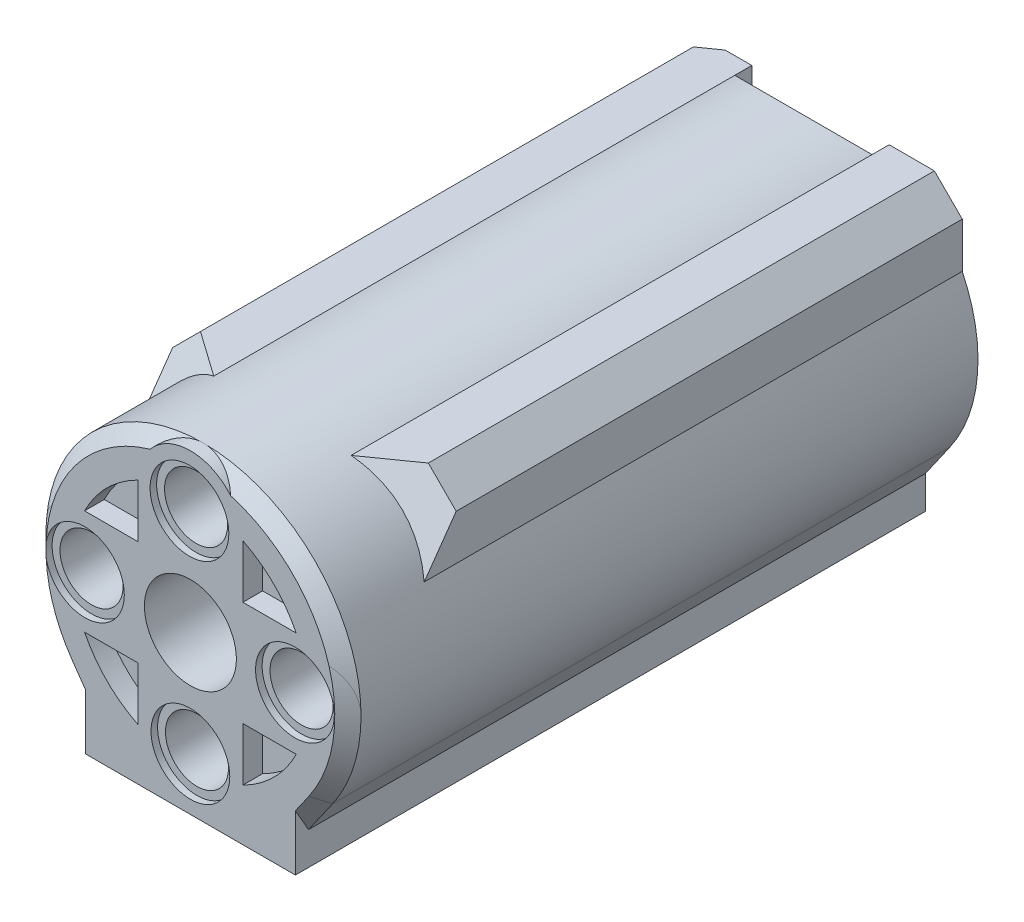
ISO-10303-21;
HEADER;
FILE_DESCRIPTION(('STEP AP214'),'2;1');
FILE_NAME('part.step','',(''),(''),'','','');
FILE_SCHEMA(('AUTOMOTIVE_DESIGN { 1 0 10303 214 1 1 1 1 }'));
ENDSEC;
DATA;
#1=APPLICATION_CONTEXT('core data for automotive mechanical design processes');
#2=APPLICATION_PROTOCOL_DEFINITION('international standard','automotive_design',2000,#1);
#3=PRODUCT_CONTEXT('',#1,'mechanical');
#4=PRODUCT('Part','Part','',(#3));
#5=PRODUCT_RELATED_PRODUCT_CATEGORY('part','',(#4));
#6=PRODUCT_DEFINITION_FORMATION('','',#4);
#7=PRODUCT_DEFINITION_CONTEXT('part definition',#1,'design');
#8=PRODUCT_DEFINITION('design','',#6,#7);
#9=PRODUCT_DEFINITION_SHAPE('','',#8);
#10=(LENGTH_UNIT() NAMED_UNIT(*) SI_UNIT(.MILLI.,.METRE.));
#11=(NAMED_UNIT(*) PLANE_ANGLE_UNIT() SI_UNIT($,.RADIAN.));
#12=(NAMED_UNIT(*) SI_UNIT($,.STERADIAN.) SOLID_ANGLE_UNIT());
#13=UNCERTAINTY_MEASURE_WITH_UNIT(LENGTH_MEASURE(1.E-05),#10,'distance_accuracy_value','');
#14=(GEOMETRIC_REPRESENTATION_CONTEXT(3) GLOBAL_UNCERTAINTY_ASSIGNED_CONTEXT((#13)) GLOBAL_UNIT_ASSIGNED_CONTEXT((#10,
#11,#12)) REPRESENTATION_CONTEXT('',''));
#15=CARTESIAN_POINT('',(0.,0.,0.));
#16=DIRECTION('',(0.,0.,1.));
#17=DIRECTION('',(1.,0.,0.));
#18=AXIS2_PLACEMENT_3D('',#15,#16,#17);
#19=CARTESIAN_POINT('',(0.,-10.1,0.));
#20=DIRECTION('',(0.,-1.,0.));
#21=DIRECTION('',(0.,0.,-1.));
#22=AXIS2_PLACEMENT_3D('',#19,#20,#21);
#23=PLANE('',#22);
#24=DIRECTION('',(1.,0.,0.));
#25=VECTOR('',#24,1.);
#26=CARTESIAN_POINT('',(-3.25,-10.1,16.));
#27=LINE('',#26,#25);
#28=CARTESIAN_POINT('',(1.16189500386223,-10.1,16.));
#29=VERTEX_POINT('',#28);
#30=CARTESIAN_POINT('',(3.25,-10.1,16.));
#31=VERTEX_POINT('',#30);
#32=EDGE_CURVE('E390',#29,#31,#27,.T.);
#33=ORIENTED_EDGE('',*,*,#32,.F.);
#34=DIRECTION('',(0.,0.,1.));
#35=VECTOR('',#34,1.);
#36=CARTESIAN_POINT('',(1.16189500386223,-10.1,24.));
#37=LINE('',#36,#35);
#38=CARTESIAN_POINT('',(1.16189500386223,-10.1,17.));
#39=VERTEX_POINT('',#38);
#40=EDGE_CURVE('E375',#29,#39,#37,.T.);
#41=ORIENTED_EDGE('',*,*,#40,.T.);
#42=DIRECTION('',(-1.,0.,0.));
#43=VECTOR('',#42,1.);
#44=CARTESIAN_POINT('',(3.25,-10.1,17.));
#45=LINE('',#44,#43);
#46=CARTESIAN_POINT('',(3.25,-10.1,17.));
#47=VERTEX_POINT('',#46);
#48=EDGE_CURVE('E389',#47,#39,#45,.T.);
#49=ORIENTED_EDGE('',*,*,#48,.F.);
#50=DIRECTION('',(0.,0.,1.));
#51=VECTOR('',#50,1.);
#52=CARTESIAN_POINT('',(3.25,-10.1,16.));
#53=LINE('',#52,#51);
#54=EDGE_CURVE('E403',#31,#47,#53,.T.);
#55=ORIENTED_EDGE('',*,*,#54,.F.);
#56=EDGE_LOOP('',(#33,#41,#49,#55));
#57=FACE_BOUND('',#56,.T.);
#58=ADVANCED_FACE('F45',(#57),#23,.F.);
#59=CARTESIAN_POINT('',(-8.67867965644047,10.8,18.));
#60=DIRECTION('',(0.,1.,0.));
#61=DIRECTION('',(0.,0.,1.));
#62=AXIS2_PLACEMENT_3D('',#59,#60,#61);
#63=PLANE('',#62);
#64=DIRECTION('',(0.816496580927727,0.,-0.577350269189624));
#65=VECTOR('',#64,1.);
#66=CARTESIAN_POINT('',(5.2306787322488,10.8,16.9901048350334));
#67=LINE('',#66,#65);
#68=CARTESIAN_POINT('',(5.23067873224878,10.8,16.9901048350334));
#69=VERTEX_POINT('',#68);
#70=CARTESIAN_POINT('',(8.67867965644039,10.8,14.5520000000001));
#71=VERTEX_POINT('',#70);
#72=EDGE_CURVE('E1297',#69,#71,#67,.T.);
#73=ORIENTED_EDGE('',*,*,#72,.T.);
#74=DIRECTION('',(0.,0.,-1.));
#75=VECTOR('',#74,1.);
#76=CARTESIAN_POINT('',(8.67867965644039,10.8,18.));
#77=LINE('',#76,#75);
#78=CARTESIAN_POINT('',(8.67867965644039,10.8,-24.));
#79=VERTEX_POINT('',#78);
#80=EDGE_CURVE('E1296',#71,#79,#77,.T.);
#81=ORIENTED_EDGE('',*,*,#80,.T.);
#82=DIRECTION('',(1.,0.,0.));
#83=VECTOR('',#82,1.);
#84=CARTESIAN_POINT('',(10.8,10.8,-24.));
#85=LINE('',#84,#83);
#86=CARTESIAN_POINT('',(5.2306787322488,10.8,-24.));
#87=VERTEX_POINT('',#86);
#88=EDGE_CURVE('E536',#87,#79,#85,.T.);
#89=ORIENTED_EDGE('',*,*,#88,.F.);
#90=DIRECTION('',(0.,0.,-1.));
#91=VECTOR('',#90,1.);
#92=CARTESIAN_POINT('',(5.2306787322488,10.8,-22.7));
#93=LINE('',#92,#91);
#94=CARTESIAN_POINT('',(5.2306787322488,10.8,-22.7));
#95=VERTEX_POINT('',#94);
#96=EDGE_CURVE('E519',#95,#87,#93,.T.);
#97=ORIENTED_EDGE('',*,*,#96,.F.);
#98=DIRECTION('',(0.,0.,-1.));
#99=VECTOR('',#98,1.);
#100=CARTESIAN_POINT('',(5.2306787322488,10.8,24.));
#101=LINE('',#100,#99);
#102=EDGE_CURVE('E1135',#69,#95,#101,.T.);
#103=ORIENTED_EDGE('',*,*,#102,.F.);
#104=EDGE_LOOP('',(#73,#81,#89,#97,#103));
#105=FACE_BOUND('',#104,.T.);
#106=ADVANCED_FACE('F572',(#105),#63,.T.);
#107=CARTESIAN_POINT('',(0.,0.,-24.));
#108=DIRECTION('',(0.,0.,1.));
#109=DIRECTION('',(1.,0.,0.));
#110=AXIS2_PLACEMENT_3D('',#107,#108,#109);
#111=PLANE('',#110);
#112=DIRECTION('',(0.,1.,0.));
#113=VECTOR('',#112,1.);
#114=CARTESIAN_POINT('',(-10.8,10.8,-24.));
#115=LINE('',#114,#113);
#116=CARTESIAN_POINT('',(-10.8,2.08806130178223,-24.));
#117=VERTEX_POINT('',#116);
#118=CARTESIAN_POINT('',(-10.8,7.26446609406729,-24.));
#119=VERTEX_POINT('',#118);
#120=EDGE_CURVE('E547',#117,#119,#115,.T.);
#121=ORIENTED_EDGE('',*,*,#120,.T.);
#122=DIRECTION('',(0.707106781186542,0.707106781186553,0.));
#123=VECTOR('',#122,1.);
#124=CARTESIAN_POINT('',(-7.97157287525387,10.0928932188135,-24.));
#125=LINE('',#124,#123);
#126=CARTESIAN_POINT('',(-7.26446609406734,10.8,-24.));
#127=VERTEX_POINT('',#126);
#128=EDGE_CURVE('E1285',#119,#127,#125,.T.);
#129=ORIENTED_EDGE('',*,*,#128,.T.);
#130=CARTESIAN_POINT('',(-5.2306787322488,10.8,-24.));
#131=VERTEX_POINT('',#130);
#132=EDGE_CURVE('E537',#127,#131,#85,.T.);
#133=ORIENTED_EDGE('',*,*,#132,.T.);
#134=DIRECTION('',(0.,-1.,0.));
#135=VECTOR('',#134,1.);
#136=CARTESIAN_POINT('',(-5.2306787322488,10.8,-24.));
#137=LINE('',#136,#135);
#138=CARTESIAN_POINT('',(-5.2306787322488,9.5,-24.));
#139=VERTEX_POINT('',#138);
#140=EDGE_CURVE('E529',#131,#139,#137,.T.);
#141=ORIENTED_EDGE('',*,*,#140,.T.);
#142=DIRECTION('',(-1.,0.,0.));
#143=VECTOR('',#142,1.);
#144=CARTESIAN_POINT('',(5.2306787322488,9.5,-24.));
#145=LINE('',#144,#143);
#146=CARTESIAN_POINT('',(5.2306787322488,9.5,-24.));
#147=VERTEX_POINT('',#146);
#148=EDGE_CURVE('E526',#147,#139,#145,.T.);
#149=ORIENTED_EDGE('',*,*,#148,.F.);
#150=DIRECTION('',(0.,-1.,0.));
#151=VECTOR('',#150,1.);
#152=CARTESIAN_POINT('',(5.2306787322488,10.8,-24.));
#153=LINE('',#152,#151);
#154=EDGE_CURVE('E521',#87,#147,#153,.T.);
#155=ORIENTED_EDGE('',*,*,#154,.F.);
#156=ORIENTED_EDGE('',*,*,#88,.T.);
#157=DIRECTION('',(-0.707106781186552,0.707106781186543,0.));
#158=VECTOR('',#157,1.);
#159=CARTESIAN_POINT('',(10.8,8.67867965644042,-24.));
#160=LINE('',#159,#158);
#161=CARTESIAN_POINT('',(10.8,8.67867965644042,-24.));
#162=VERTEX_POINT('',#161);
#163=EDGE_CURVE('E1298',#79,#162,#160,.F.);
#164=ORIENTED_EDGE('',*,*,#163,.T.);
#165=DIRECTION('',(0.,-1.,0.));
#166=VECTOR('',#165,1.);
#167=CARTESIAN_POINT('',(10.8,5.23067873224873,-24.));
#168=LINE('',#167,#166);
#169=CARTESIAN_POINT('',(10.8,5.23067873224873,-24.));
#170=VERTEX_POINT('',#169);
#171=EDGE_CURVE('E539',#162,#170,#168,.T.);
#172=ORIENTED_EDGE('',*,*,#171,.T.);
#173=CARTESIAN_POINT('',(0.,0.,-24.));
#174=DIRECTION('',(0.,0.,-1.));
#175=DIRECTION('',(1.,0.,0.));
#176=AXIS2_PLACEMENT_3D('',#173,#174,#175);
#177=CIRCLE('',#176,12.);
#178=CARTESIAN_POINT('',(9.83454185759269,-6.87617527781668,-24.));
#179=VERTEX_POINT('',#178);
#180=EDGE_CURVE('E541',#170,#179,#177,.T.);
#181=ORIENTED_EDGE('',*,*,#180,.T.);
#182=DIRECTION('',(-0.573014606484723,-0.819545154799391,0.));
#183=VECTOR('',#182,1.);
#184=CARTESIAN_POINT('',(8.,-9.5,-24.));
#185=LINE('',#184,#183);
#186=CARTESIAN_POINT('',(8.,-9.5,-24.));
#187=VERTEX_POINT('',#186);
#188=EDGE_CURVE('E544',#179,#187,#185,.T.);
#189=ORIENTED_EDGE('',*,*,#188,.T.);
#190=DIRECTION('',(0.,1.,0.));
#191=VECTOR('',#190,1.);
#192=CARTESIAN_POINT('',(8.,-12.,-24.));
#193=LINE('',#192,#191);
#194=CARTESIAN_POINT('',(8.,-12.,-24.));
#195=VERTEX_POINT('',#194);
#196=EDGE_CURVE('E512',#195,#187,#193,.T.);
#197=ORIENTED_EDGE('',*,*,#196,.F.);
#198=DIRECTION('',(1.,0.,0.));
#199=VECTOR('',#198,1.);
#200=CARTESIAN_POINT('',(8.,-12.,-24.));
#201=LINE('',#200,#199);
#202=CARTESIAN_POINT('',(-8.,-12.,-24.));
#203=VERTEX_POINT('',#202);
#204=EDGE_CURVE('E505',#203,#195,#201,.T.);
#205=ORIENTED_EDGE('',*,*,#204,.F.);
#206=DIRECTION('',(0.,1.,0.));
#207=VECTOR('',#206,1.);
#208=CARTESIAN_POINT('',(-8.,-12.,-24.));
#209=LINE('',#208,#207);
#210=CARTESIAN_POINT('',(-8.,-7.75484378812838,-24.));
#211=VERTEX_POINT('',#210);
#212=EDGE_CURVE('E515',#203,#211,#209,.T.);
#213=ORIENTED_EDGE('',*,*,#212,.T.);
#214=DIRECTION('',(-0.573014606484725,0.81954515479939,0.));
#215=VECTOR('',#214,1.);
#216=CARTESIAN_POINT('',(-9.01499670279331,-6.30316067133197,-24.));
#217=LINE('',#216,#215);
#218=CARTESIAN_POINT('',(-9.01499670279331,-6.30316067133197,-24.));
#219=VERTEX_POINT('',#218);
#220=EDGE_CURVE('E1438',#211,#219,#217,.T.);
#221=ORIENTED_EDGE('',*,*,#220,.T.);
#222=CARTESIAN_POINT('',(0.,0.,-24.));
#223=DIRECTION('',(0.,0.,1.));
#224=DIRECTION('',(1.,0.,0.));
#225=AXIS2_PLACEMENT_3D('',#222,#223,#224);
#226=CIRCLE('',#225,11.);
#227=EDGE_CURVE('E1435',#219,#117,#226,.F.);
#228=ORIENTED_EDGE('',*,*,#227,.T.);
#229=EDGE_LOOP('',(#121,#129,#133,#141,#149,#155,#156,#164,#172,#181,#189,#197,#205,#213,#221,#228));
#230=FACE_BOUND('',#229,.T.);
#231=ADVANCED_FACE('F568',(#230),#111,.F.);
#232=CARTESIAN_POINT('',(0.,0.,24.));
#233=DIRECTION('',(0.,0.,1.));
#234=DIRECTION('',(1.,0.,0.));
#235=AXIS2_PLACEMENT_3D('',#232,#233,#234);
#236=PLANE('',#235);
#237=CARTESIAN_POINT('',(7.965,0.0349999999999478,24.));
#238=DIRECTION('',(0.,0.,1.));
#239=DIRECTION('',(1.,0.,0.));
#240=AXIS2_PLACEMENT_3D('',#237,#238,#239);
#241=CIRCLE('',#240,2.99999999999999);
#242=CARTESIAN_POINT('',(10.965,0.0349999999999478,24.));
#243=VERTEX_POINT('',#242);
#244=EDGE_CURVE('E2049',#243,#243,#241,.T.);
#245=ORIENTED_EDGE('',*,*,#244,.F.);
#246=EDGE_LOOP('',(#245));
#247=FACE_BOUND('',#246,.T.);
#248=CARTESIAN_POINT('',(0.,0.,24.));
#249=DIRECTION('',(0.,0.,-1.));
#250=DIRECTION('',(-1.,0.,0.));
#251=AXIS2_PLACEMENT_3D('',#248,#249,#250);
#252=CIRCLE('',#251,11.);
#253=CARTESIAN_POINT('',(-10.5625,3.0714155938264,24.));
#254=VERTEX_POINT('',#253);
#255=CARTESIAN_POINT('',(-3.07141559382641,10.5625,24.));
#256=VERTEX_POINT('',#255);
#257=EDGE_CURVE('E1517',#254,#256,#252,.T.);
#258=ORIENTED_EDGE('',*,*,#257,.F.);
#259=CARTESIAN_POINT('',(0.,0.,24.));
#260=DIRECTION('',(0.,0.,1.));
#261=DIRECTION('',(1.,0.,0.));
#262=AXIS2_PLACEMENT_3D('',#259,#260,#261);
#263=CIRCLE('',#262,11.);
#264=CARTESIAN_POINT('',(-10.9892067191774,0.487171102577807,24.));
#265=VERTEX_POINT('',#264);
#266=EDGE_CURVE('E1471',#254,#265,#263,.T.);
#267=ORIENTED_EDGE('',*,*,#266,.T.);
#268=CARTESIAN_POINT('',(-8.035,-0.0349999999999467,24.));
#269=DIRECTION('',(0.,0.,1.));
#270=DIRECTION('',(1.,0.,0.));
#271=AXIS2_PLACEMENT_3D('',#268,#269,#270);
#272=CIRCLE('',#271,2.99999999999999);
#273=CARTESIAN_POINT('',(-10.9845456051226,-0.582887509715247,24.));
#274=VERTEX_POINT('',#273);
#275=EDGE_CURVE('E2037',#274,#265,#272,.T.);
#276=ORIENTED_EDGE('',*,*,#275,.F.);
#277=CARTESIAN_POINT('',(0.,0.,24.));
#278=DIRECTION('',(0.,0.,1.));
#279=DIRECTION('',(1.,0.,0.));
#280=AXIS2_PLACEMENT_3D('',#277,#278,#279);
#281=CIRCLE('',#280,11.);
#282=CARTESIAN_POINT('',(-9.01499670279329,-6.30316067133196,24.));
#283=VERTEX_POINT('',#282);
#284=EDGE_CURVE('E1476',#274,#283,#281,.T.);
#285=ORIENTED_EDGE('',*,*,#284,.T.);
#286=DIRECTION('',(0.573014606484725,-0.81954515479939,0.));
#287=VECTOR('',#286,1.);
#288=CARTESIAN_POINT('',(-9.01499670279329,-6.30316067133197,24.));
#289=LINE('',#288,#287);
#290=CARTESIAN_POINT('',(-8.,-7.75484378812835,24.));
#291=VERTEX_POINT('',#290);
#292=EDGE_CURVE('E1472',#283,#291,#289,.T.);
#293=ORIENTED_EDGE('',*,*,#292,.T.);
#294=DIRECTION('',(0.,1.,0.));
#295=VECTOR('',#294,1.);
#296=CARTESIAN_POINT('',(-8.,-12.,24.));
#297=LINE('',#296,#295);
#298=CARTESIAN_POINT('',(-8.,-12.,24.));
#299=VERTEX_POINT('',#298);
#300=EDGE_CURVE('E511',#299,#291,#297,.T.);
#301=ORIENTED_EDGE('',*,*,#300,.F.);
#302=DIRECTION('',(-1.,0.,0.));
#303=VECTOR('',#302,1.);
#304=CARTESIAN_POINT('',(-8.,-12.,24.));
#305=LINE('',#304,#303);
#306=CARTESIAN_POINT('',(8.,-12.,24.));
#307=VERTEX_POINT('',#306);
#308=EDGE_CURVE('E509',#307,#299,#305,.T.);
#309=ORIENTED_EDGE('',*,*,#308,.F.);
#310=DIRECTION('',(0.,1.,0.));
#311=VECTOR('',#310,1.);
#312=CARTESIAN_POINT('',(8.,-12.,24.));
#313=LINE('',#312,#311);
#314=CARTESIAN_POINT('',(8.,-7.75484378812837,24.));
#315=VERTEX_POINT('',#314);
#316=EDGE_CURVE('E516',#307,#315,#313,.T.);
#317=ORIENTED_EDGE('',*,*,#316,.T.);
#318=DIRECTION('',(0.573014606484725,0.81954515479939,0.));
#319=VECTOR('',#318,1.);
#320=CARTESIAN_POINT('',(9.0149967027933,-6.30316067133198,24.));
#321=LINE('',#320,#319);
#322=CARTESIAN_POINT('',(9.0149967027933,-6.30316067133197,24.));
#323=VERTEX_POINT('',#322);
#324=EDGE_CURVE('E1481',#315,#323,#321,.T.);
#325=ORIENTED_EDGE('',*,*,#324,.T.);
#326=CARTESIAN_POINT('',(0.,0.,24.));
#327=DIRECTION('',(0.,0.,1.));
#328=DIRECTION('',(1.,0.,0.));
#329=AXIS2_PLACEMENT_3D('',#326,#327,#328);
#330=CIRCLE('',#329,11.);
#331=CARTESIAN_POINT('',(10.5625,3.0714155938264,24.));
#332=VERTEX_POINT('',#331);
#333=EDGE_CURVE('E1478',#323,#332,#330,.T.);
#334=ORIENTED_EDGE('',*,*,#333,.T.);
#335=CARTESIAN_POINT('',(3.0714155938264,10.5625,24.));
#336=VERTEX_POINT('',#335);
#337=EDGE_CURVE('E1510',#336,#332,#252,.T.);
#338=ORIENTED_EDGE('',*,*,#337,.F.);
#339=CARTESIAN_POINT('',(0.,8.,24.));
#340=DIRECTION('',(0.,0.,1.));
#341=DIRECTION('',(1.,0.,0.));
#342=AXIS2_PLACEMENT_3D('',#339,#340,#341);
#343=CIRCLE('',#342,4.);
#344=EDGE_CURVE('E550',#256,#336,#343,.F.);
#345=ORIENTED_EDGE('',*,*,#344,.F.);
#346=EDGE_LOOP('',(#258,#267,#276,#285,#293,#301,#309,#317,#325,#334,#338,#345));
#347=FACE_BOUND('',#346,.T.);
#348=CARTESIAN_POINT('',(-0.0699999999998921,8.,24.));
#349=DIRECTION('',(0.,0.,1.));
#350=DIRECTION('',(1.,0.,0.));
#351=AXIS2_PLACEMENT_3D('',#348,#349,#350);
#352=CIRCLE('',#351,3.);
#353=CARTESIAN_POINT('',(2.9300000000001,8.,24.));
#354=VERTEX_POINT('',#353);
#355=EDGE_CURVE('E2025',#354,#354,#352,.T.);
#356=ORIENTED_EDGE('',*,*,#355,.F.);
#357=EDGE_LOOP('',(#356));
#358=FACE_BOUND('',#357,.T.);
#359=CARTESIAN_POINT('',(0.,-8.,24.));
#360=DIRECTION('',(0.,0.,1.));
#361=DIRECTION('',(1.,0.,0.));
#362=AXIS2_PLACEMENT_3D('',#359,#360,#361);
#363=CIRCLE('',#362,3.);
#364=CARTESIAN_POINT('',(3.,-8.,24.));
#365=VERTEX_POINT('',#364);
#366=EDGE_CURVE('E2013',#365,#365,#363,.T.);
#367=ORIENTED_EDGE('',*,*,#366,.F.);
#368=EDGE_LOOP('',(#367));
#369=FACE_BOUND('',#368,.T.);
#370=CARTESIAN_POINT('',(0.,0.,24.));
#371=DIRECTION('',(0.,0.,1.));
#372=DIRECTION('',(1.,0.,0.));
#373=AXIS2_PLACEMENT_3D('',#370,#371,#372);
#374=CIRCLE('',#373,9.);
#375=CARTESIAN_POINT('',(8.06225774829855,4.,24.));
#376=VERTEX_POINT('',#375);
#377=CARTESIAN_POINT('',(4.,8.06225774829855,24.));
#378=VERTEX_POINT('',#377);
#379=EDGE_CURVE('E1865',#376,#378,#374,.T.);
#380=ORIENTED_EDGE('',*,*,#379,.F.);
#381=DIRECTION('',(1.,0.,0.));
#382=VECTOR('',#381,1.);
#383=CARTESIAN_POINT('',(4.,4.,24.));
#384=LINE('',#383,#382);
#385=CARTESIAN_POINT('',(4.,4.,24.));
#386=VERTEX_POINT('',#385);
#387=EDGE_CURVE('E1870',#386,#376,#384,.T.);
#388=ORIENTED_EDGE('',*,*,#387,.F.);
#389=DIRECTION('',(0.,-1.,0.));
#390=VECTOR('',#389,1.);
#391=CARTESIAN_POINT('',(4.,8.06225774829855,24.));
#392=LINE('',#391,#390);
#393=EDGE_CURVE('E1878',#378,#386,#392,.T.);
#394=ORIENTED_EDGE('',*,*,#393,.F.);
#395=EDGE_LOOP('',(#380,#388,#394));
#396=FACE_BOUND('',#395,.T.);
#397=DIRECTION('',(-1.,0.,0.));
#398=VECTOR('',#397,1.);
#399=CARTESIAN_POINT('',(8.06225774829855,-4.,24.));
#400=LINE('',#399,#398);
#401=CARTESIAN_POINT('',(8.06225774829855,-4.00000000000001,24.));
#402=VERTEX_POINT('',#401);
#403=CARTESIAN_POINT('',(4.,-4.,24.));
#404=VERTEX_POINT('',#403);
#405=EDGE_CURVE('E1885',#402,#404,#400,.T.);
#406=ORIENTED_EDGE('',*,*,#405,.F.);
#407=CARTESIAN_POINT('',(0.,0.,24.));
#408=DIRECTION('',(0.,0.,1.));
#409=DIRECTION('',(1.,0.,0.));
#410=AXIS2_PLACEMENT_3D('',#407,#408,#409);
#411=CIRCLE('',#410,9.);
#412=CARTESIAN_POINT('',(4.,-8.06225774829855,24.));
#413=VERTEX_POINT('',#412);
#414=EDGE_CURVE('E1894',#413,#402,#411,.T.);
#415=ORIENTED_EDGE('',*,*,#414,.F.);
#416=DIRECTION('',(0.,-1.,0.));
#417=VECTOR('',#416,1.);
#418=CARTESIAN_POINT('',(4.,-4.,24.));
#419=LINE('',#418,#417);
#420=EDGE_CURVE('E1902',#404,#413,#419,.T.);
#421=ORIENTED_EDGE('',*,*,#420,.F.);
#422=EDGE_LOOP('',(#406,#415,#421));
#423=FACE_BOUND('',#422,.T.);
#424=CARTESIAN_POINT('',(0.,0.,24.));
#425=DIRECTION('',(0.,0.,1.));
#426=DIRECTION('',(1.,0.,0.));
#427=AXIS2_PLACEMENT_3D('',#424,#425,#426);
#428=CIRCLE('',#427,9.);
#429=CARTESIAN_POINT('',(-8.06225774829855,-4.,24.));
#430=VERTEX_POINT('',#429);
#431=CARTESIAN_POINT('',(-4.,-8.06225774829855,24.));
#432=VERTEX_POINT('',#431);
#433=EDGE_CURVE('E1909',#430,#432,#428,.T.);
#434=ORIENTED_EDGE('',*,*,#433,.F.);
#435=DIRECTION('',(-1.,0.,0.));
#436=VECTOR('',#435,1.);
#437=CARTESIAN_POINT('',(-4.,-4.,24.));
#438=LINE('',#437,#436);
#439=CARTESIAN_POINT('',(-4.,-4.,24.));
#440=VERTEX_POINT('',#439);
#441=EDGE_CURVE('E1918',#440,#430,#438,.T.);
#442=ORIENTED_EDGE('',*,*,#441,.F.);
#443=DIRECTION('',(0.,1.,0.));
#444=VECTOR('',#443,1.);
#445=CARTESIAN_POINT('',(-4.,-8.06225774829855,24.));
#446=LINE('',#445,#444);
#447=EDGE_CURVE('E1926',#432,#440,#446,.T.);
#448=ORIENTED_EDGE('',*,*,#447,.F.);
#449=EDGE_LOOP('',(#434,#442,#448));
#450=FACE_BOUND('',#449,.T.);
#451=DIRECTION('',(1.,0.,0.));
#452=VECTOR('',#451,1.);
#453=CARTESIAN_POINT('',(-8.06225774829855,4.,24.));
#454=LINE('',#453,#452);
#455=CARTESIAN_POINT('',(-8.06225774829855,4.,24.));
#456=VERTEX_POINT('',#455);
#457=CARTESIAN_POINT('',(-4.,4.,24.));
#458=VERTEX_POINT('',#457);
#459=EDGE_CURVE('E1933',#456,#458,#454,.T.);
#460=ORIENTED_EDGE('',*,*,#459,.F.);
#461=CARTESIAN_POINT('',(0.,0.,24.));
#462=DIRECTION('',(0.,0.,1.));
#463=DIRECTION('',(1.,0.,0.));
#464=AXIS2_PLACEMENT_3D('',#461,#462,#463);
#465=CIRCLE('',#464,9.);
#466=CARTESIAN_POINT('',(-4.,8.06225774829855,24.));
#467=VERTEX_POINT('',#466);
#468=EDGE_CURVE('E1942',#467,#456,#465,.T.);
#469=ORIENTED_EDGE('',*,*,#468,.F.);
#470=DIRECTION('',(0.,1.,0.));
#471=VECTOR('',#470,1.);
#472=CARTESIAN_POINT('',(-4.,4.,24.));
#473=LINE('',#472,#471);
#474=EDGE_CURVE('E1949',#458,#467,#473,.T.);
#475=ORIENTED_EDGE('',*,*,#474,.F.);
#476=EDGE_LOOP('',(#460,#469,#475));
#477=FACE_BOUND('',#476,.T.);
#478=CARTESIAN_POINT('',(0.,0.,24.));
#479=DIRECTION('',(0.,0.,1.));
#480=DIRECTION('',(1.,0.,0.));
#481=AXIS2_PLACEMENT_3D('',#478,#479,#480);
#482=CIRCLE('',#481,3.50499999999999);
#483=CARTESIAN_POINT('',(3.50499999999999,0.,24.));
#484=VERTEX_POINT('',#483);
#485=EDGE_CURVE('E431',#484,#484,#482,.T.);
#486=ORIENTED_EDGE('',*,*,#485,.F.);
#487=EDGE_LOOP('',(#486));
#488=FACE_BOUND('',#487,.T.);
#489=ADVANCED_FACE('F571',(#247,#347,#358,#369,#396,#423,#450,#477,#488),#236,.T.);
#490=CARTESIAN_POINT('',(0.,0.,23.));
#491=DIRECTION('',(0.,0.,-1.));
#492=DIRECTION('',(-1.,0.,0.));
#493=AXIS2_PLACEMENT_3D('',#490,#491,#492);
#494=CONICAL_SURFACE('',#493,12.,0.785398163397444);
#495=CARTESIAN_POINT('',(3.07161559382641,10.562260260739,24.000174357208));
#496=CARTESIAN_POINT('',(3.00770010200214,10.6388922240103,23.9444393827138));
#497=CARTESIAN_POINT('',(2.94029563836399,10.713855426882,23.8903452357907));
#498=CARTESIAN_POINT('',(2.79857094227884,10.8597798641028,23.7857588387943));
#499=CARTESIAN_POINT('',(2.72424530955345,10.9307379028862,23.735269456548));
#500=CARTESIAN_POINT('',(2.56834245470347,11.0683049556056,23.637990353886));
#501=CARTESIAN_POINT('',(2.48672173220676,11.1348831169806,23.5912264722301));
#502=CARTESIAN_POINT('',(2.31691514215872,11.2623876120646,23.5021661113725));
#503=CARTESIAN_POINT('',(2.22873080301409,11.3233152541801,23.4598685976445));
#504=CARTESIAN_POINT('',(2.04568107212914,11.4390366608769,23.3799228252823));
#505=CARTESIAN_POINT('',(1.95078329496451,11.4937968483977,23.3422999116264));
#506=CARTESIAN_POINT('',(1.75526116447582,11.5960010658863,23.2723727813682));
#507=CARTESIAN_POINT('',(1.65463745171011,11.6434459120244,23.2400679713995));
#508=CARTESIAN_POINT('',(1.44864296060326,11.7301319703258,23.181244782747));
#509=CARTESIAN_POINT('',(1.34328649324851,11.7693961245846,23.1547102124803));
#510=CARTESIAN_POINT('',(1.12842176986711,11.8391949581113,23.107663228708));
#511=CARTESIAN_POINT('',(1.01891417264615,11.869731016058,23.0871498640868));
#512=CARTESIAN_POINT('',(0.809087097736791,11.9186302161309,23.0543597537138));
#513=CARTESIAN_POINT('',(0.70909698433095,11.9379683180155,23.0414214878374));
#514=CARTESIAN_POINT('',(0.507415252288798,11.9689968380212,23.0206820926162));
#515=CARTESIAN_POINT('',(0.40572381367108,11.9806880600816,23.012880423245));
#516=CARTESIAN_POINT('',(0.20144267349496,11.9962379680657,23.0025071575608));
#517=CARTESIAN_POINT('',(0.0988526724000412,12.0000939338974,22.9999373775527));
#518=CARTESIAN_POINT('',(-0.106313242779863,11.9999025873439,23.0000649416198));
#519=CARTESIAN_POINT('',(-0.208889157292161,11.9958556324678,23.0027620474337));
#520=CARTESIAN_POINT('',(-0.40486719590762,11.9805704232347,23.0129590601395));
#521=CARTESIAN_POINT('',(-0.498338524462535,11.9699421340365,23.0200516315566));
#522=CARTESIAN_POINT('',(-0.683891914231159,11.9422213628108,23.0385776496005));
#523=CARTESIAN_POINT('',(-0.775973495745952,11.9251266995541,23.0500125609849));
#524=CARTESIAN_POINT('',(-1.04901549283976,11.8644806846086,23.0906571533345));
#525=CARTESIAN_POINT('',(-1.22706832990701,11.8115434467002,23.1262224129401));
#526=CARTESIAN_POINT('',(-1.57395509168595,11.6820726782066,23.213775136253));
#527=CARTESIAN_POINT('',(-1.7425504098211,11.60511104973,23.2660609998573));
#528=CARTESIAN_POINT('',(-2.06383183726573,11.4313265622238,23.3851488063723));
#529=CARTESIAN_POINT('',(-2.21649596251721,11.334476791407,23.4519704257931));
#530=CARTESIAN_POINT('',(-2.49570523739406,11.130448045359,23.5942148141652));
#531=CARTESIAN_POINT('',(-2.62322252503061,11.0241243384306,23.6689668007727));
#532=CARTESIAN_POINT('',(-2.80131802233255,10.856440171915,23.7881928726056));
#533=CARTESIAN_POINT('',(-2.85840677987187,10.7992755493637,23.8290479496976));
#534=CARTESIAN_POINT('',(-2.9682539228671,10.6825147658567,23.9129806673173));
#535=CARTESIAN_POINT('',(-3.02101378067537,10.6229194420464,23.9560575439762));
#536=CARTESIAN_POINT('',(-3.07161559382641,10.562260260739,24.000174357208));
#537=B_SPLINE_CURVE_WITH_KNOTS('',3,(#495,#496,#497,#498,#499,#500,#501,#502,#503,#504,#505,
#506,#507,#508,#509,#510,#511,#512,#513,#514,#515,#516,#517,#518,#519,#520,#521,#522,#523,#524,
#525,#526,#527,#528,#529,#530,#531,#532,#533,#534,#535,#536),.UNSPECIFIED.,.F.,.F.,(4,2,2,2,2,2,
2,2,2,2,2,2,2,2,2,2,2,2,2,2,4),(0.,0.342865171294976,0.686000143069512,1.03133851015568,
1.37659671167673,1.72365196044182,2.0706684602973,2.41669827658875,2.76267340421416,
3.07024523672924,3.37778472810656,3.68543096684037,3.99306328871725,4.27574141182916,
4.55851497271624,5.1231834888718,5.69855137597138,6.27470301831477,6.81932601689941,
7.09078302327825,7.36214731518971),.UNSPECIFIED.);
#538=CARTESIAN_POINT('',(0.,12.,23.));
#539=VERTEX_POINT('',#538);
#540=EDGE_CURVE('E1333',#336,#539,#537,.T.);
#541=ORIENTED_EDGE('',*,*,#540,.F.);
#542=ORIENTED_EDGE('',*,*,#337,.T.);
#543=CARTESIAN_POINT('',(10.5625,3.0714155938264,24.));
#544=CARTESIAN_POINT('',(10.639111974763,3.00750661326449,23.9442804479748));
#545=CARTESIAN_POINT('',(10.7140555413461,2.94011021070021,23.8902012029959));
#546=CARTESIAN_POINT('',(10.859942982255,2.79840357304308,23.7856425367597));
#547=CARTESIAN_POINT('',(10.9308835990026,2.72408783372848,23.7351660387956));
#548=CARTESIAN_POINT('',(11.0684396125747,2.56818214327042,23.6378955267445));
#549=CARTESIAN_POINT('',(11.135022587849,2.48654648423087,23.5911286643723));
#550=CARTESIAN_POINT('',(11.2625336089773,2.31671019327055,23.5020645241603));
#551=CARTESIAN_POINT('',(11.3234630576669,2.22851119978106,23.4597661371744));
#552=CARTESIAN_POINT('',(11.439225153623,2.04536859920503,23.3797929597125));
#553=CARTESIAN_POINT('',(11.4940198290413,1.95038836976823,23.3421468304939));
#554=CARTESIAN_POINT('',(11.5962794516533,1.75469679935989,23.2721828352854));
#555=CARTESIAN_POINT('',(11.6437453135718,1.65398617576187,23.2398643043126));
#556=CARTESIAN_POINT('',(11.7303934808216,1.44796117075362,23.1810678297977));
#557=CARTESIAN_POINT('',(11.7696110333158,1.34266879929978,23.1545650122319));
#558=CARTESIAN_POINT('',(11.839319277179,1.12799498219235,23.1075797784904));
#559=CARTESIAN_POINT('',(11.8698133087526,1.01861511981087,23.0870950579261));
#560=CARTESIAN_POINT('',(11.929951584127,0.760435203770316,23.0467675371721));
#561=CARTESIAN_POINT('',(11.9560810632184,0.610403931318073,23.0293089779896));
#562=CARTESIAN_POINT('',(11.9823586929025,0.383014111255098,23.0117654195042));
#563=CARTESIAN_POINT('',(11.9889653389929,0.30665381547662,23.0073581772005));
#564=CARTESIAN_POINT('',(11.997787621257,0.153538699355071,23.0014748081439));
#565=CARTESIAN_POINT('',(12.0000015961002,0.0767837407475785,22.9999997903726));
#566=CARTESIAN_POINT('',(12.,0.,23.));
#567=B_SPLINE_CURVE_WITH_KNOTS('',3,(#543,#544,#545,#546,#547,#548,#549,#550,#551,#552,#553,
#554,#555,#556,#557,#558,#559,#560,#561,#562,#563,#564,#565,#566),.UNSPECIFIED.,.F.,.F.,(4,2,2,
2,2,2,2,2,2,2,2,4),(0.,0.342791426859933,0.685857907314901,1.03123970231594,1.37653556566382,
1.72386258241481,2.07114621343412,2.41691422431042,2.76254966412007,3.22081140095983,
3.45097280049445,3.68122123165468),.UNSPECIFIED.);
#568=CARTESIAN_POINT('',(12.,0.,23.));
#569=VERTEX_POINT('',#568);
#570=EDGE_CURVE('E560',#332,#569,#567,.T.);
#571=ORIENTED_EDGE('',*,*,#570,.T.);
#572=CARTESIAN_POINT('',(0.,0.,23.));
#573=DIRECTION('',(0.,0.,-1.));
#574=DIRECTION('',(-1.,0.,0.));
#575=AXIS2_PLACEMENT_3D('',#572,#573,#574);
#576=CIRCLE('',#575,12.);
#577=EDGE_CURVE('E1538',#539,#569,#576,.T.);
#578=ORIENTED_EDGE('',*,*,#577,.F.);
#579=EDGE_LOOP('',(#541,#542,#571,#578));
#580=FACE_BOUND('',#579,.T.);
#581=ADVANCED_FACE('F1242',(#580),#494,.T.);
#582=CARTESIAN_POINT('',(0.,0.,24.));
#583=DIRECTION('',(0.,0.,-1.));
#584=DIRECTION('',(-1.,0.,0.));
#585=AXIS2_PLACEMENT_3D('',#582,#583,#584);
#586=CYLINDRICAL_SURFACE('',#585,12.);
#587=DIRECTION('',(0.,0.,-1.));
#588=VECTOR('',#587,1.);
#589=CARTESIAN_POINT('',(-9.83454185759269,-6.87617527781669,24.));
#590=LINE('',#589,#588);
#591=CARTESIAN_POINT('',(-9.83454185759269,-6.87617527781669,-23.));
#592=VERTEX_POINT('',#591);
#593=CARTESIAN_POINT('',(-9.83454185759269,-6.87617527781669,23.));
#594=VERTEX_POINT('',#593);
#595=EDGE_CURVE('E1023',#592,#594,#590,.F.);
#596=ORIENTED_EDGE('',*,*,#595,.T.);
#597=CARTESIAN_POINT('',(0.,0.,23.));
#598=DIRECTION('',(0.,0.,1.));
#599=DIRECTION('',(1.,0.,0.));
#600=AXIS2_PLACEMENT_3D('',#597,#598,#599);
#601=CIRCLE('',#600,12.);
#602=CARTESIAN_POINT('',(-12.,0.,23.));
#603=VERTEX_POINT('',#602);
#604=EDGE_CURVE('E1442',#594,#603,#601,.F.);
#605=ORIENTED_EDGE('',*,*,#604,.T.);
#606=EDGE_CURVE('E1452',#603,#539,#576,.T.);
#607=ORIENTED_EDGE('',*,*,#606,.T.);
#608=ORIENTED_EDGE('',*,*,#577,.T.);
#609=CARTESIAN_POINT('',(0.,0.,23.));
#610=DIRECTION('',(0.,0.,1.));
#611=DIRECTION('',(1.,0.,0.));
#612=AXIS2_PLACEMENT_3D('',#609,#610,#611);
#613=CIRCLE('',#612,12.);
#614=CARTESIAN_POINT('',(9.83454185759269,-6.87617527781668,23.));
#615=VERTEX_POINT('',#614);
#616=EDGE_CURVE('E862',#569,#615,#613,.F.);
#617=ORIENTED_EDGE('',*,*,#616,.T.);
#618=DIRECTION('',(0.,0.,-1.));
#619=VECTOR('',#618,1.);
#620=CARTESIAN_POINT('',(9.83454185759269,-6.87617527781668,24.));
#621=LINE('',#620,#619);
#622=EDGE_CURVE('E1016',#615,#179,#621,.T.);
#623=ORIENTED_EDGE('',*,*,#622,.T.);
#624=ORIENTED_EDGE('',*,*,#180,.F.);
#625=DIRECTION('',(0.,0.,-1.));
#626=VECTOR('',#625,1.);
#627=CARTESIAN_POINT('',(10.8,5.23067873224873,24.));
#628=LINE('',#627,#626);
#629=CARTESIAN_POINT('',(10.8,5.23067873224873,16.9901048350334));
#630=VERTEX_POINT('',#629);
#631=EDGE_CURVE('E1145',#170,#630,#628,.F.);
#632=ORIENTED_EDGE('',*,*,#631,.T.);
#633=CARTESIAN_POINT('',(0.,0.,28.3255064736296));
#634=DIRECTION('',(0.500000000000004,0.499999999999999,0.707106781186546));
#635=DIRECTION('',(0.500000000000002,0.499999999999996,-0.707106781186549));
#636=AXIS2_PLACEMENT_3D('',#633,#634,#635);
#637=ELLIPSE('',#636,16.9705627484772,12.);
#638=EDGE_CURVE('E1142',#630,#69,#637,.T.);
#639=ORIENTED_EDGE('',*,*,#638,.T.);
#640=ORIENTED_EDGE('',*,*,#102,.T.);
#641=CARTESIAN_POINT('',(0.,0.,-33.5000000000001));
#642=DIRECTION('',(0.,-0.707106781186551,0.707106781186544));
#643=DIRECTION('',(0.,-0.707106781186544,-0.707106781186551));
#644=AXIS2_PLACEMENT_3D('',#641,#642,#643);
#645=ELLIPSE('',#644,16.9705627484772,12.);
#646=CARTESIAN_POINT('',(-5.2306787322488,10.8,-22.7));
#647=VERTEX_POINT('',#646);
#648=EDGE_CURVE('E1141',#95,#647,#645,.T.);
#649=ORIENTED_EDGE('',*,*,#648,.T.);
#650=DIRECTION('',(0.,0.,-1.));
#651=VECTOR('',#650,1.);
#652=CARTESIAN_POINT('',(-5.2306787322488,10.8,24.));
#653=LINE('',#652,#651);
#654=CARTESIAN_POINT('',(-5.2306787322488,10.8,16.9901048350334));
#655=VERTEX_POINT('',#654);
#656=EDGE_CURVE('E1143',#647,#655,#653,.F.);
#657=ORIENTED_EDGE('',*,*,#656,.T.);
#658=CARTESIAN_POINT('',(0.,0.,28.3255064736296));
#659=DIRECTION('',(0.500000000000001,-0.500000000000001,-0.707106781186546));
#660=DIRECTION('',(-0.499999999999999,0.499999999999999,-0.707106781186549));
#661=AXIS2_PLACEMENT_3D('',#658,#659,#660);
#662=ELLIPSE('',#661,16.9705627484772,12.);
#663=CARTESIAN_POINT('',(-10.8,5.23067873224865,16.9901048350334));
#664=VERTEX_POINT('',#663);
#665=EDGE_CURVE('E1025',#655,#664,#662,.F.);
#666=ORIENTED_EDGE('',*,*,#665,.T.);
#667=DIRECTION('',(0.,0.,-1.));
#668=VECTOR('',#667,1.);
#669=CARTESIAN_POINT('',(-10.8000000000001,5.23067873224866,24.));
#670=LINE('',#669,#668);
#671=CARTESIAN_POINT('',(-10.8000000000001,5.23067873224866,-23.));
#672=VERTEX_POINT('',#671);
#673=EDGE_CURVE('E1380',#664,#672,#670,.T.);
#674=ORIENTED_EDGE('',*,*,#673,.T.);
#675=CARTESIAN_POINT('',(0.,0.,-23.));
#676=DIRECTION('',(0.,0.,1.));
#677=DIRECTION('',(1.,0.,0.));
#678=AXIS2_PLACEMENT_3D('',#675,#676,#677);
#679=CIRCLE('',#678,12.);
#680=EDGE_CURVE('E1436',#672,#592,#679,.T.);
#681=ORIENTED_EDGE('',*,*,#680,.T.);
#682=EDGE_LOOP('',(#596,#605,#607,#608,#617,#623,#624,#632,#639,#640,#649,#657,#666,#674,#681));
#683=FACE_BOUND('',#682,.T.);
#684=ADVANCED_FACE('F903',(#683),#586,.T.);
#685=CARTESIAN_POINT('',(8.,-9.5,-44.3255118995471));
#686=DIRECTION('',(0.81954515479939,-0.573014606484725,0.));
#687=DIRECTION('',(0.573014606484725,0.81954515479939,0.));
#688=AXIS2_PLACEMENT_3D('',#685,#686,#687);
#689=PLANE('',#688);
#690=ORIENTED_EDGE('',*,*,#622,.F.);
#691=DIRECTION('',(-0.573014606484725,-0.81954515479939,0.));
#692=VECTOR('',#691,1.);
#693=CARTESIAN_POINT('',(8.,-9.5,23.));
#694=LINE('',#693,#692);
#695=CARTESIAN_POINT('',(8.,-9.5,23.));
#696=VERTEX_POINT('',#695);
#697=EDGE_CURVE('E62',#615,#696,#694,.T.);
#698=ORIENTED_EDGE('',*,*,#697,.T.);
#699=DIRECTION('',(0.,0.,1.));
#700=VECTOR('',#699,1.);
#701=CARTESIAN_POINT('',(8.,-9.5,-44.3255118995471));
#702=LINE('',#701,#700);
#703=EDGE_CURVE('E1450',#696,#187,#702,.F.);
#704=ORIENTED_EDGE('',*,*,#703,.T.);
#705=ORIENTED_EDGE('',*,*,#188,.F.);
#706=EDGE_LOOP('',(#690,#698,#704,#705));
#707=FACE_BOUND('',#706,.T.);
#708=ADVANCED_FACE('F1244',(#707),#689,.T.);
#709=CARTESIAN_POINT('',(-8.,-9.5,-44.3255118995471));
#710=DIRECTION('',(-0.81954515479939,-0.573014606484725,0.));
#711=DIRECTION('',(0.573014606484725,-0.81954515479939,0.));
#712=AXIS2_PLACEMENT_3D('',#709,#710,#711);
#713=PLANE('',#712);
#714=DIRECTION('',(0.,0.,1.));
#715=VECTOR('',#714,1.);
#716=CARTESIAN_POINT('',(-8.,-9.5,-44.3255118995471));
#717=LINE('',#716,#715);
#718=CARTESIAN_POINT('',(-8.,-9.5,-23.));
#719=VERTEX_POINT('',#718);
#720=CARTESIAN_POINT('',(-8.,-9.5,23.));
#721=VERTEX_POINT('',#720);
#722=EDGE_CURVE('E1022',#719,#721,#717,.T.);
#723=ORIENTED_EDGE('',*,*,#722,.T.);
#724=DIRECTION('',(-0.573014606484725,0.81954515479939,0.));
#725=VECTOR('',#724,1.);
#726=CARTESIAN_POINT('',(-8.,-9.5,23.));
#727=LINE('',#726,#725);
#728=EDGE_CURVE('E863',#721,#594,#727,.T.);
#729=ORIENTED_EDGE('',*,*,#728,.T.);
#730=ORIENTED_EDGE('',*,*,#595,.F.);
#731=DIRECTION('',(0.573014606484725,-0.81954515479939,0.));
#732=VECTOR('',#731,1.);
#733=CARTESIAN_POINT('',(-8.,-9.5,-23.));
#734=LINE('',#733,#732);
#735=EDGE_CURVE('E1466',#592,#719,#734,.T.);
#736=ORIENTED_EDGE('',*,*,#735,.T.);
#737=EDGE_LOOP('',(#723,#729,#730,#736));
#738=FACE_BOUND('',#737,.T.);
#739=ADVANCED_FACE('F1237',(#738),#713,.T.);
#740=CARTESIAN_POINT('',(10.8,8.67867965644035,18.));
#741=DIRECTION('',(1.,0.,0.));
#742=DIRECTION('',(0.,1.,0.));
#743=AXIS2_PLACEMENT_3D('',#740,#741,#742);
#744=PLANE('',#743);
#745=ORIENTED_EDGE('',*,*,#171,.F.);
#746=DIRECTION('',(0.,0.,1.));
#747=VECTOR('',#746,1.);
#748=CARTESIAN_POINT('',(10.8,8.67867965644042,18.));
#749=LINE('',#748,#747);
#750=CARTESIAN_POINT('',(10.8,8.67867965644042,14.552));
#751=VERTEX_POINT('',#750);
#752=EDGE_CURVE('E382',#162,#751,#749,.T.);
#753=ORIENTED_EDGE('',*,*,#752,.T.);
#754=DIRECTION('',(0.,0.816496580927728,-0.577350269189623));
#755=VECTOR('',#754,1.);
#756=CARTESIAN_POINT('',(10.8,5.23067873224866,16.9901048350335));
#757=LINE('',#756,#755);
#758=EDGE_CURVE('E1021',#630,#751,#757,.T.);
#759=ORIENTED_EDGE('',*,*,#758,.F.);
#760=ORIENTED_EDGE('',*,*,#631,.F.);
#761=EDGE_LOOP('',(#745,#753,#759,#760));
#762=FACE_BOUND('',#761,.T.);
#763=ADVANCED_FACE('F1231',(#762),#744,.T.);
#764=CARTESIAN_POINT('',(8.67867965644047,10.8,14.552));
#765=DIRECTION('',(0.500000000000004,0.499999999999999,0.707106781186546));
#766=DIRECTION('',(0.816496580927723,0.,-0.57735026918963));
#767=AXIS2_PLACEMENT_3D('',#764,#765,#766);
#768=PLANE('',#767);
#769=ORIENTED_EDGE('',*,*,#758,.T.);
#770=DIRECTION('',(0.707106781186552,-0.707106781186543,0.));
#771=VECTOR('',#770,1.);
#772=CARTESIAN_POINT('',(8.67867965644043,10.8,14.5520000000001));
#773=LINE('',#772,#771);
#774=EDGE_CURVE('E1299',#751,#71,#773,.F.);
#775=ORIENTED_EDGE('',*,*,#774,.T.);
#776=ORIENTED_EDGE('',*,*,#72,.F.);
#777=ORIENTED_EDGE('',*,*,#638,.F.);
#778=EDGE_LOOP('',(#769,#775,#776,#777));
#779=FACE_BOUND('',#778,.T.);
#780=ADVANCED_FACE('F1236',(#779),#768,.T.);
#781=CARTESIAN_POINT('',(-5.2306787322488,9.5,-24.));
#782=DIRECTION('',(0.,-0.707106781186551,0.707106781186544));
#783=DIRECTION('',(0.,-0.707106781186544,-0.707106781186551));
#784=AXIS2_PLACEMENT_3D('',#781,#782,#783);
#785=PLANE('',#784);
#786=ORIENTED_EDGE('',*,*,#648,.F.);
#787=DIRECTION('',(0.,0.707106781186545,0.70710678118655));
#788=VECTOR('',#787,1.);
#789=CARTESIAN_POINT('',(5.2306787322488,9.5,-24.));
#790=LINE('',#789,#788);
#791=EDGE_CURVE('E524',#147,#95,#790,.T.);
#792=ORIENTED_EDGE('',*,*,#791,.F.);
#793=ORIENTED_EDGE('',*,*,#148,.T.);
#794=DIRECTION('',(0.,0.707106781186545,0.70710678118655));
#795=VECTOR('',#794,1.);
#796=CARTESIAN_POINT('',(-5.2306787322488,9.5,-24.));
#797=LINE('',#796,#795);
#798=EDGE_CURVE('E522',#139,#647,#797,.T.);
#799=ORIENTED_EDGE('',*,*,#798,.T.);
#800=EDGE_LOOP('',(#786,#792,#793,#799));
#801=FACE_BOUND('',#800,.T.);
#802=ADVANCED_FACE('F1270',(#801),#785,.F.);
#803=ORIENTED_EDGE('',*,*,#132,.F.);
#804=DIRECTION('',(0.816496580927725,0.,-0.577350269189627));
#805=VECTOR('',#804,1.);
#806=CARTESIAN_POINT('',(-28.0062650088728,10.8,-9.33333333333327));
#807=LINE('',#806,#805);
#808=CARTESIAN_POINT('',(-8.67867965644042,10.8,-23.));
#809=VERTEX_POINT('',#808);
#810=EDGE_CURVE('E1279',#127,#809,#807,.F.);
#811=ORIENTED_EDGE('',*,*,#810,.T.);
#812=DIRECTION('',(0.,0.,1.));
#813=VECTOR('',#812,1.);
#814=CARTESIAN_POINT('',(-8.67867965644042,10.8,18.));
#815=LINE('',#814,#813);
#816=CARTESIAN_POINT('',(-8.67867965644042,10.8,14.552));
#817=VERTEX_POINT('',#816);
#818=EDGE_CURVE('E1301',#809,#817,#815,.T.);
#819=ORIENTED_EDGE('',*,*,#818,.T.);
#820=DIRECTION('',(0.816496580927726,0.,0.577350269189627));
#821=VECTOR('',#820,1.);
#822=CARTESIAN_POINT('',(-8.67867965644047,10.8,14.552));
#823=LINE('',#822,#821);
#824=EDGE_CURVE('E1306',#817,#655,#823,.T.);
#825=ORIENTED_EDGE('',*,*,#824,.T.);
#826=ORIENTED_EDGE('',*,*,#656,.F.);
#827=DIRECTION('',(0.,0.,-1.));
#828=VECTOR('',#827,1.);
#829=CARTESIAN_POINT('',(-5.2306787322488,10.8,-22.7));
#830=LINE('',#829,#828);
#831=EDGE_CURVE('E518',#647,#131,#830,.T.);
#832=ORIENTED_EDGE('',*,*,#831,.T.);
#833=EDGE_LOOP('',(#803,#811,#819,#825,#826,#832));
#834=FACE_BOUND('',#833,.T.);
#835=ADVANCED_FACE('F1265',(#834),#63,.T.);
#836=CARTESIAN_POINT('',(-8.67867965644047,10.8,14.552));
#837=DIRECTION('',(0.500000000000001,-0.500000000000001,-0.707106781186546));
#838=DIRECTION('',(0.,0.816496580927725,-0.577350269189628));
#839=AXIS2_PLACEMENT_3D('',#836,#837,#838);
#840=PLANE('',#839);
#841=ORIENTED_EDGE('',*,*,#824,.F.);
#842=DIRECTION('',(0.707106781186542,0.707106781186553,0.));
#843=VECTOR('',#842,1.);
#844=CARTESIAN_POINT('',(-8.67867965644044,10.8,14.552));
#845=LINE('',#844,#843);
#846=CARTESIAN_POINT('',(-10.8,8.67867965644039,14.552));
#847=VERTEX_POINT('',#846);
#848=EDGE_CURVE('E1429',#817,#847,#845,.F.);
#849=ORIENTED_EDGE('',*,*,#848,.T.);
#850=DIRECTION('',(0.,0.816496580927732,-0.577350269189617));
#851=VECTOR('',#850,1.);
#852=CARTESIAN_POINT('',(-10.8,5.23067873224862,16.9901048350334));
#853=LINE('',#852,#851);
#854=EDGE_CURVE('E1309',#664,#847,#853,.T.);
#855=ORIENTED_EDGE('',*,*,#854,.F.);
#856=ORIENTED_EDGE('',*,*,#665,.F.);
#857=EDGE_LOOP('',(#841,#849,#855,#856));
#858=FACE_BOUND('',#857,.T.);
#859=ADVANCED_FACE('F901',(#858),#840,.F.);
#860=CARTESIAN_POINT('',(-10.8,8.67867965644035,18.));
#861=DIRECTION('',(-1.,0.,0.));
#862=DIRECTION('',(0.,-1.,0.));
#863=AXIS2_PLACEMENT_3D('',#860,#861,#862);
#864=PLANE('',#863);
#865=DIRECTION('',(0.,0.,-1.));
#866=VECTOR('',#865,1.);
#867=CARTESIAN_POINT('',(-10.8,8.67867965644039,18.));
#868=LINE('',#867,#866);
#869=CARTESIAN_POINT('',(-10.8,8.67867965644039,-23.));
#870=VERTEX_POINT('',#869);
#871=EDGE_CURVE('E1483',#847,#870,#868,.T.);
#872=ORIENTED_EDGE('',*,*,#871,.T.);
#873=DIRECTION('',(0.,0.816496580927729,0.577350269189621));
#874=VECTOR('',#873,1.);
#875=CARTESIAN_POINT('',(-10.8,28.0062650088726,-9.33333333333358));
#876=LINE('',#875,#874);
#877=EDGE_CURVE('E1448',#870,#119,#876,.F.);
#878=ORIENTED_EDGE('',*,*,#877,.T.);
#879=ORIENTED_EDGE('',*,*,#120,.F.);
#880=CARTESIAN_POINT('',(-10.8,2.08806130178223,-24.));
#881=CARTESIAN_POINT('',(-10.8,2.35919720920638,-23.9485722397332));
#882=CARTESIAN_POINT('',(-10.8,2.62842622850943,-23.887761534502));
#883=CARTESIAN_POINT('',(-10.8,3.16174057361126,-23.7496350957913));
#884=CARTESIAN_POINT('',(-10.8,3.42583932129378,-23.6723714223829));
#885=CARTESIAN_POINT('',(-10.8,3.9491402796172,-23.5032923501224));
#886=CARTESIAN_POINT('',(-10.8,4.20834468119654,-23.4114836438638));
#887=CARTESIAN_POINT('',(-10.8,4.72274822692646,-23.2149325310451));
#888=CARTESIAN_POINT('',(-10.8,4.97793230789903,-23.1101505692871));
#889=CARTESIAN_POINT('',(-10.8,5.23067873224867,-23.0000000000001));
#890=B_SPLINE_CURVE_WITH_KNOTS('',3,(#880,#881,#882,#883,#884,#885,#886,#887,#888,#889),
.UNSPECIFIED.,.F.,.F.,(4,2,2,2,4),(0.,0.827566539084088,1.65255242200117,2.47715980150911,
3.30434634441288),.UNSPECIFIED.);
#891=EDGE_CURVE('E886',#117,#672,#890,.T.);
#892=ORIENTED_EDGE('',*,*,#891,.T.);
#893=ORIENTED_EDGE('',*,*,#673,.F.);
#894=ORIENTED_EDGE('',*,*,#854,.T.);
#895=EDGE_LOOP('',(#872,#878,#879,#892,#893,#894));
#896=FACE_BOUND('',#895,.T.);
#897=ADVANCED_FACE('F895',(#896),#864,.T.);
#898=CARTESIAN_POINT('',(-3.0714155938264,10.5625,24.));
#899=CARTESIAN_POINT('',(-3.00751861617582,10.6390975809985,23.9442909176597));
#900=CARTESIAN_POINT('',(-2.9401355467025,10.7140273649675,23.8902215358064));
#901=CARTESIAN_POINT('',(-2.7984581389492,10.8598888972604,23.7856811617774));
#902=CARTESIAN_POINT('',(-2.72415829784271,10.9308173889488,23.7352130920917));
#903=CARTESIAN_POINT('',(-2.56825769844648,11.0683770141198,23.6379395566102));
#904=CARTESIAN_POINT('',(-2.48660868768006,11.1349739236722,23.5911627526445));
#905=CARTESIAN_POINT('',(-2.31674310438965,11.262510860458,23.5020803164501));
#906=CARTESIAN_POINT('',(-2.22852817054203,11.3234522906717,23.4597735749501));
#907=CARTESIAN_POINT('',(-2.04539197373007,11.4392104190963,23.3798031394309));
#908=CARTESIAN_POINT('',(-1.95043684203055,11.4939919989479,23.3421659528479));
#909=CARTESIAN_POINT('',(-1.75479789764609,11.5962291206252,23.2722171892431));
#910=CARTESIAN_POINT('',(-1.65411482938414,11.6436856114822,23.2399049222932));
#911=CARTESIAN_POINT('',(-1.44809671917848,11.7303420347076,23.1811026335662));
#912=CARTESIAN_POINT('',(-1.34278106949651,11.769573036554,23.1545906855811));
#913=CARTESIAN_POINT('',(-1.12804756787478,11.8393037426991,23.1075901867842));
#914=CARTESIAN_POINT('',(-1.01863132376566,11.869806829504,23.0870993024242));
#915=CARTESIAN_POINT('',(-0.760196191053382,11.9300108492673,23.0467279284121));
#916=CARTESIAN_POINT('',(-0.609953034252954,11.9561709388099,23.0292495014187));
#917=CARTESIAN_POINT('',(-0.306450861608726,11.9911684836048,23.0058832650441));
#918=CARTESIAN_POINT('',(-0.153190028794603,11.9999951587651,23.0000026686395));
#919=CARTESIAN_POINT('',(0.0981452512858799,12.0000031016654,22.9999982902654));
#920=CARTESIAN_POINT('',(0.196261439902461,11.9963851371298,23.0024092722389));
#921=CARTESIAN_POINT('',(0.391757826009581,11.9819751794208,23.0120215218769));
#922=CARTESIAN_POINT('',(0.489137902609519,11.9711820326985,23.0192235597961));
#923=CARTESIAN_POINT('',(0.682372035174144,11.9425758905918,23.038340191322));
#924=CARTESIAN_POINT('',(0.778226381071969,11.9247642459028,23.0502538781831));
#925=CARTESIAN_POINT('',(0.967750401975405,11.8823840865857,23.078660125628));
#926=CARTESIAN_POINT('',(1.06141923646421,11.8578130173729,23.0951544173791));
#927=CARTESIAN_POINT('',(1.33737775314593,11.7746701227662,23.1511127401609));
#928=CARTESIAN_POINT('',(1.51557275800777,11.7065233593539,23.1971483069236));
#929=CARTESIAN_POINT('',(1.85678409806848,11.5479379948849,23.3051334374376));
#930=CARTESIAN_POINT('',(2.01977384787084,11.4574613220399,23.3671101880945));
#931=CARTESIAN_POINT('',(2.2609230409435,11.3013748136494,23.4750910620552));
#932=CARTESIAN_POINT('',(2.34529796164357,11.241920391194,23.5164200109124));
#933=CARTESIAN_POINT('',(2.50793808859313,11.1178044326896,23.6032129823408));
#934=CARTESIAN_POINT('',(2.58620125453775,11.0531411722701,23.6486783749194));
#935=CARTESIAN_POINT('',(2.73605927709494,10.9195921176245,23.7431933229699));
#936=CARTESIAN_POINT('',(2.80767797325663,10.8507230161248,23.7922288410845));
#937=CARTESIAN_POINT('',(2.94442052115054,10.7092556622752,23.8936653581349));
#938=CARTESIAN_POINT('',(3.00954966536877,10.6366605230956,23.9460635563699));
#939=CARTESIAN_POINT('',(3.0714155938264,10.5625,24.));
#940=B_SPLINE_CURVE_WITH_KNOTS('',3,(#898,#899,#900,#901,#902,#903,#904,#905,#906,#907,#908,
#909,#910,#911,#912,#913,#914,#915,#916,#917,#918,#919,#920,#921,#922,#923,#924,#925,#926,#927,
#928,#929,#930,#931,#932,#933,#934,#935,#936,#937,#938,#939),.UNSPECIFIED.,.F.,.F.,(4,2,2,2,2,2,
2,2,2,2,2,2,2,2,2,2,2,2,2,2,4),(0.,0.342727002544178,0.68572903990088,1.03117525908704,
1.37653555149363,1.72377441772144,2.07096825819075,2.41682605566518,2.76254963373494,
3.22160562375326,3.68094702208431,3.97523626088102,4.26957282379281,4.5638527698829,
4.85824408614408,5.44415723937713,6.03107634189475,6.3643058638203,6.69764615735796,
7.02974004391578,7.36156083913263),.UNSPECIFIED.);
#941=EDGE_CURVE('E551',#256,#539,#940,.T.);
#942=ORIENTED_EDGE('',*,*,#941,.T.);
#943=ORIENTED_EDGE('',*,*,#606,.F.);
#944=CARTESIAN_POINT('',(-12.,0.,23.));
#945=CARTESIAN_POINT('',(-12.000018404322,0.0985421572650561,22.9999907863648));
#946=CARTESIAN_POINT('',(-11.9963590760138,0.197074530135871,23.0024273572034));
#947=CARTESIAN_POINT('',(-11.981824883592,0.39333273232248,23.0121210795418));
#948=CARTESIAN_POINT('',(-11.9709525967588,0.491058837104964,23.0193765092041));
#949=CARTESIAN_POINT('',(-11.9422407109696,0.684259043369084,23.0385645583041));
#950=CARTESIAN_POINT('',(-11.9244541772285,0.779744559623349,23.0504615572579));
#951=CARTESIAN_POINT('',(-11.8821838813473,0.968512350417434,23.078794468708));
#952=CARTESIAN_POINT('',(-11.85769983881,1.061794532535,23.0952305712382));
#953=CARTESIAN_POINT('',(-11.7747155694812,1.33722761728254,23.1510821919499));
#954=CARTESIAN_POINT('',(-11.7066348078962,1.51528196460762,23.1970730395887));
#955=CARTESIAN_POINT('',(-11.5480852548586,1.85651838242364,23.3050325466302));
#956=CARTESIAN_POINT('',(-11.4575422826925,2.01964867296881,23.3670541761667));
#957=CARTESIAN_POINT('',(-11.301360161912,2.2609457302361,23.4751011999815));
#958=CARTESIAN_POINT('',(-11.2418896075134,2.34534166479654,23.5164414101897));
#959=CARTESIAN_POINT('',(-11.117738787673,2.50802074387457,23.6032590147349));
#960=CARTESIAN_POINT('',(-11.0530567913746,2.58630184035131,23.6487377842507));
#961=CARTESIAN_POINT('',(-10.919502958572,2.73615343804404,23.7432567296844));
#962=CARTESIAN_POINT('',(-10.850650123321,2.80775107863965,23.792280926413));
#963=CARTESIAN_POINT('',(-10.7092176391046,2.94445462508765,23.8936928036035));
#964=CARTESIAN_POINT('',(-10.6366411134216,3.00956584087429,23.9460776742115));
#965=CARTESIAN_POINT('',(-10.5625,3.0714155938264,24.));
#966=B_SPLINE_CURVE_WITH_KNOTS('',3,(#944,#945,#946,#947,#948,#949,#950,#951,#952,#953,#954,
#955,#956,#957,#958,#959,#960,#961,#962,#963,#964,#965),.UNSPECIFIED.,.F.,.F.,(4,2,2,2,2,2,2,2,
2,2,4),(0.,0.295512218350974,0.590918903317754,0.884101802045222,1.17729697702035,
1.76273329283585,2.35012934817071,2.6834450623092,3.01687193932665,3.34887991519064,
3.68061382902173),.UNSPECIFIED.);
#967=EDGE_CURVE('E1506',#603,#254,#966,.T.);
#968=ORIENTED_EDGE('',*,*,#967,.T.);
#969=ORIENTED_EDGE('',*,*,#257,.T.);
#970=EDGE_LOOP('',(#942,#943,#968,#969));
#971=FACE_BOUND('',#970,.T.);
#972=ADVANCED_FACE('F900',(#971),#494,.T.);
#973=CARTESIAN_POINT('',(0.,8.,22.));
#974=DIRECTION('',(0.,0.,1.));
#975=DIRECTION('',(1.,0.,0.));
#976=AXIS2_PLACEMENT_3D('',#973,#974,#975);
#977=CYLINDRICAL_SURFACE('',#976,4.);
#978=ORIENTED_EDGE('',*,*,#344,.T.);
#979=ORIENTED_EDGE('',*,*,#540,.T.);
#980=ORIENTED_EDGE('',*,*,#941,.F.);
#981=EDGE_LOOP('',(#978,#979,#980));
#982=FACE_BOUND('',#981,.T.);
#983=ADVANCED_FACE('F563',(#982),#977,.T.);
#984=CARTESIAN_POINT('',(5.2306787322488,0.,0.));
#985=DIRECTION('',(-1.,0.,0.));
#986=DIRECTION('',(0.,0.,1.));
#987=AXIS2_PLACEMENT_3D('',#984,#985,#986);
#988=PLANE('',#987);
#989=ORIENTED_EDGE('',*,*,#96,.T.);
#990=ORIENTED_EDGE('',*,*,#154,.T.);
#991=ORIENTED_EDGE('',*,*,#791,.T.);
#992=EDGE_LOOP('',(#989,#990,#991));
#993=FACE_BOUND('',#992,.T.);
#994=ADVANCED_FACE('F578',(#993),#988,.T.);
#995=CARTESIAN_POINT('',(-5.2306787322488,0.,0.));
#996=DIRECTION('',(-1.,0.,0.));
#997=DIRECTION('',(0.,0.,1.));
#998=AXIS2_PLACEMENT_3D('',#995,#996,#997);
#999=PLANE('',#998);
#1000=ORIENTED_EDGE('',*,*,#831,.F.);
#1001=ORIENTED_EDGE('',*,*,#798,.F.);
#1002=ORIENTED_EDGE('',*,*,#140,.F.);
#1003=EDGE_LOOP('',(#1000,#1001,#1002));
#1004=FACE_BOUND('',#1003,.T.);
#1005=ADVANCED_FACE('F574',(#1004),#999,.F.);
#1006=CARTESIAN_POINT('',(-8.,-12.,-24.));
#1007=DIRECTION('',(1.,0.,0.));
#1008=DIRECTION('',(0.,0.,-1.));
#1009=AXIS2_PLACEMENT_3D('',#1006,#1007,#1008);
#1010=PLANE('',#1009);
#1011=ORIENTED_EDGE('',*,*,#722,.F.);
#1012=DIRECTION('',(0.,0.867649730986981,-0.49717596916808));
#1013=VECTOR('',#1012,1.);
#1014=CARTESIAN_POINT('',(-8.,-10.9506655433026,-22.1687474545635));
#1015=LINE('',#1014,#1013);
#1016=EDGE_CURVE('E54',#719,#211,#1015,.T.);
#1017=ORIENTED_EDGE('',*,*,#1016,.T.);
#1018=ORIENTED_EDGE('',*,*,#212,.F.);
#1019=DIRECTION('',(0.,0.,-1.));
#1020=VECTOR('',#1019,1.);
#1021=CARTESIAN_POINT('',(-8.,-12.,-24.));
#1022=LINE('',#1021,#1020);
#1023=EDGE_CURVE('E496',#299,#203,#1022,.T.);
#1024=ORIENTED_EDGE('',*,*,#1023,.F.);
#1025=ORIENTED_EDGE('',*,*,#300,.T.);
#1026=DIRECTION('',(0.,0.867649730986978,0.497175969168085));
#1027=VECTOR('',#1026,1.);
#1028=CARTESIAN_POINT('',(-8.,-31.6566461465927,10.3039181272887));
#1029=LINE('',#1028,#1027);
#1030=EDGE_CURVE('E893',#291,#721,#1029,.F.);
#1031=ORIENTED_EDGE('',*,*,#1030,.T.);
#1032=EDGE_LOOP('',(#1011,#1017,#1018,#1024,#1025,#1031));
#1033=FACE_BOUND('',#1032,.T.);
#1034=ADVANCED_FACE('F577',(#1033),#1010,.F.);
#1035=CARTESIAN_POINT('',(8.,-12.,24.));
#1036=DIRECTION('',(-1.,0.,0.));
#1037=DIRECTION('',(0.,0.,1.));
#1038=AXIS2_PLACEMENT_3D('',#1035,#1036,#1037);
#1039=PLANE('',#1038);
#1040=ORIENTED_EDGE('',*,*,#703,.F.);
#1041=DIRECTION('',(0.,-0.867649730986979,-0.497175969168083));
#1042=VECTOR('',#1041,1.);
#1043=CARTESIAN_POINT('',(8.,-10.9506655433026,22.1687474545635));
#1044=LINE('',#1043,#1042);
#1045=EDGE_CURVE('E13',#696,#315,#1044,.F.);
#1046=ORIENTED_EDGE('',*,*,#1045,.T.);
#1047=ORIENTED_EDGE('',*,*,#316,.F.);
#1048=DIRECTION('',(0.,0.,1.));
#1049=VECTOR('',#1048,1.);
#1050=CARTESIAN_POINT('',(8.,-12.,24.));
#1051=LINE('',#1050,#1049);
#1052=EDGE_CURVE('E507',#195,#307,#1051,.T.);
#1053=ORIENTED_EDGE('',*,*,#1052,.F.);
#1054=ORIENTED_EDGE('',*,*,#196,.T.);
#1055=EDGE_LOOP('',(#1040,#1046,#1047,#1053,#1054));
#1056=FACE_BOUND('',#1055,.T.);
#1057=ADVANCED_FACE('F585',(#1056),#1039,.F.);
#1058=CARTESIAN_POINT('',(0.,-12.,0.));
#1059=DIRECTION('',(0.,1.,0.));
#1060=DIRECTION('',(0.,0.,1.));
#1061=AXIS2_PLACEMENT_3D('',#1058,#1059,#1060);
#1062=PLANE('',#1061);
#1063=DIRECTION('',(1.,0.,0.));
#1064=VECTOR('',#1063,1.);
#1065=CARTESIAN_POINT('',(1.66778791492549,-12.,-22.2970480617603));
#1066=LINE('',#1065,#1064);
#1067=CARTESIAN_POINT('',(1.66778791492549,-12.,-22.2970480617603));
#1068=VERTEX_POINT('',#1067);
#1069=CARTESIAN_POINT('',(6.46778791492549,-12.,-22.2970480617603));
#1070=VERTEX_POINT('',#1069);
#1071=EDGE_CURVE('E454',#1068,#1070,#1066,.T.);
#1072=ORIENTED_EDGE('',*,*,#1071,.F.);
#1073=DIRECTION('',(0.,0.,-1.));
#1074=VECTOR('',#1073,1.);
#1075=CARTESIAN_POINT('',(1.66778791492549,-12.,22.5029519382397));
#1076=LINE('',#1075,#1074);
#1077=CARTESIAN_POINT('',(1.66778791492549,-12.,22.5029519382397));
#1078=VERTEX_POINT('',#1077);
#1079=EDGE_CURVE('E438',#1078,#1068,#1076,.T.);
#1080=ORIENTED_EDGE('',*,*,#1079,.F.);
#1081=DIRECTION('',(-1.,0.,0.));
#1082=VECTOR('',#1081,1.);
#1083=CARTESIAN_POINT('',(6.46778791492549,-12.,22.5029519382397));
#1084=LINE('',#1083,#1082);
#1085=CARTESIAN_POINT('',(6.46778791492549,-12.,22.5029519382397));
#1086=VERTEX_POINT('',#1085);
#1087=EDGE_CURVE('E443',#1086,#1078,#1084,.T.);
#1088=ORIENTED_EDGE('',*,*,#1087,.F.);
#1089=DIRECTION('',(0.,0.,1.));
#1090=VECTOR('',#1089,1.);
#1091=CARTESIAN_POINT('',(6.46778791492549,-12.,-22.2970480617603));
#1092=LINE('',#1091,#1090);
#1093=EDGE_CURVE('E457',#1070,#1086,#1092,.T.);
#1094=ORIENTED_EDGE('',*,*,#1093,.F.);
#1095=EDGE_LOOP('',(#1072,#1080,#1088,#1094));
#1096=FACE_BOUND('',#1095,.T.);
#1097=DIRECTION('',(1.,0.,0.));
#1098=VECTOR('',#1097,1.);
#1099=CARTESIAN_POINT('',(-6.33221208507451,-12.,-22.2970480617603));
#1100=LINE('',#1099,#1098);
#1101=CARTESIAN_POINT('',(-6.33221208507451,-12.,-22.2970480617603));
#1102=VERTEX_POINT('',#1101);
#1103=CARTESIAN_POINT('',(-1.53221208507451,-12.,-22.2970480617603));
#1104=VERTEX_POINT('',#1103);
#1105=EDGE_CURVE('E486',#1102,#1104,#1100,.T.);
#1106=ORIENTED_EDGE('',*,*,#1105,.F.);
#1107=DIRECTION('',(0.,0.,-1.));
#1108=VECTOR('',#1107,1.);
#1109=CARTESIAN_POINT('',(-6.33221208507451,-12.,22.5029519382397));
#1110=LINE('',#1109,#1108);
#1111=CARTESIAN_POINT('',(-6.33221208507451,-12.,22.5029519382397));
#1112=VERTEX_POINT('',#1111);
#1113=EDGE_CURVE('E464',#1112,#1102,#1110,.T.);
#1114=ORIENTED_EDGE('',*,*,#1113,.F.);
#1115=DIRECTION('',(-1.,0.,0.));
#1116=VECTOR('',#1115,1.);
#1117=CARTESIAN_POINT('',(-1.53221208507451,-12.,22.5029519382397));
#1118=LINE('',#1117,#1116);
#1119=CARTESIAN_POINT('',(-1.53221208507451,-12.,22.5029519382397));
#1120=VERTEX_POINT('',#1119);
#1121=EDGE_CURVE('E475',#1120,#1112,#1118,.T.);
#1122=ORIENTED_EDGE('',*,*,#1121,.F.);
#1123=DIRECTION('',(0.,0.,1.));
#1124=VECTOR('',#1123,1.);
#1125=CARTESIAN_POINT('',(-1.53221208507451,-12.,-22.2970480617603));
#1126=LINE('',#1125,#1124);
#1127=EDGE_CURVE('E489',#1104,#1120,#1126,.T.);
#1128=ORIENTED_EDGE('',*,*,#1127,.F.);
#1129=EDGE_LOOP('',(#1106,#1114,#1122,#1128));
#1130=FACE_BOUND('',#1129,.T.);
#1131=ORIENTED_EDGE('',*,*,#1023,.T.);
#1132=ORIENTED_EDGE('',*,*,#204,.T.);
#1133=ORIENTED_EDGE('',*,*,#1052,.T.);
#1134=ORIENTED_EDGE('',*,*,#308,.T.);
#1135=EDGE_LOOP('',(#1131,#1132,#1133,#1134));
#1136=FACE_BOUND('',#1135,.T.);
#1137=ADVANCED_FACE('F589',(#1096,#1130,#1136),#1062,.F.);
#1138=CARTESIAN_POINT('',(-6.33221208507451,-10.4,22.5029519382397));
#1139=DIRECTION('',(-1.,0.,0.));
#1140=DIRECTION('',(0.,0.,1.));
#1141=AXIS2_PLACEMENT_3D('',#1138,#1139,#1140);
#1142=PLANE('',#1141);
#1143=ORIENTED_EDGE('',*,*,#1113,.T.);
#1144=DIRECTION('',(0.,-1.,0.));
#1145=VECTOR('',#1144,1.);
#1146=CARTESIAN_POINT('',(-6.33221208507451,-10.4,-22.2970480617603));
#1147=LINE('',#1146,#1145);
#1148=CARTESIAN_POINT('',(-6.33221208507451,-10.4,-22.2970480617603));
#1149=VERTEX_POINT('',#1148);
#1150=EDGE_CURVE('E484',#1149,#1102,#1147,.T.);
#1151=ORIENTED_EDGE('',*,*,#1150,.F.);
#1152=DIRECTION('',(0.,0.,-1.));
#1153=VECTOR('',#1152,1.);
#1154=CARTESIAN_POINT('',(-6.33221208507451,-10.4,22.5029519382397));
#1155=LINE('',#1154,#1153);
#1156=CARTESIAN_POINT('',(-6.33221208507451,-10.4,22.5029519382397));
#1157=VERTEX_POINT('',#1156);
#1158=EDGE_CURVE('E471',#1157,#1149,#1155,.T.);
#1159=ORIENTED_EDGE('',*,*,#1158,.F.);
#1160=DIRECTION('',(0.,-1.,0.));
#1161=VECTOR('',#1160,1.);
#1162=CARTESIAN_POINT('',(-6.33221208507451,-10.4,22.5029519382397));
#1163=LINE('',#1162,#1161);
#1164=EDGE_CURVE('E494',#1157,#1112,#1163,.T.);
#1165=ORIENTED_EDGE('',*,*,#1164,.T.);
#1166=EDGE_LOOP('',(#1143,#1151,#1159,#1165));
#1167=FACE_BOUND('',#1166,.T.);
#1168=ADVANCED_FACE('F593',(#1167),#1142,.F.);
#1169=CARTESIAN_POINT('',(-1.53221208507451,-10.4,22.5029519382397));
#1170=DIRECTION('',(0.,0.,1.));
#1171=DIRECTION('',(0.,-1.,0.));
#1172=AXIS2_PLACEMENT_3D('',#1169,#1170,#1171);
#1173=PLANE('',#1172);
#1174=ORIENTED_EDGE('',*,*,#1121,.T.);
#1175=ORIENTED_EDGE('',*,*,#1164,.F.);
#1176=DIRECTION('',(-1.,0.,0.));
#1177=VECTOR('',#1176,1.);
#1178=CARTESIAN_POINT('',(-1.53221208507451,-10.4,22.5029519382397));
#1179=LINE('',#1178,#1177);
#1180=CARTESIAN_POINT('',(-1.53221208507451,-10.4,22.5029519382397));
#1181=VERTEX_POINT('',#1180);
#1182=EDGE_CURVE('E481',#1181,#1157,#1179,.T.);
#1183=ORIENTED_EDGE('',*,*,#1182,.F.);
#1184=DIRECTION('',(0.,-1.,0.));
#1185=VECTOR('',#1184,1.);
#1186=CARTESIAN_POINT('',(-1.53221208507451,-10.4,22.5029519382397));
#1187=LINE('',#1186,#1185);
#1188=EDGE_CURVE('E497',#1181,#1120,#1187,.T.);
#1189=ORIENTED_EDGE('',*,*,#1188,.T.);
#1190=EDGE_LOOP('',(#1174,#1175,#1183,#1189));
#1191=FACE_BOUND('',#1190,.T.);
#1192=ADVANCED_FACE('F597',(#1191),#1173,.F.);
#1193=CARTESIAN_POINT('',(-1.53221208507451,-10.4,-22.2970480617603));
#1194=DIRECTION('',(1.,0.,0.));
#1195=DIRECTION('',(0.,0.,-1.));
#1196=AXIS2_PLACEMENT_3D('',#1193,#1194,#1195);
#1197=PLANE('',#1196);
#1198=ORIENTED_EDGE('',*,*,#1127,.T.);
#1199=ORIENTED_EDGE('',*,*,#1188,.F.);
#1200=DIRECTION('',(0.,0.,1.));
#1201=VECTOR('',#1200,1.);
#1202=CARTESIAN_POINT('',(-1.53221208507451,-10.4,-22.2970480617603));
#1203=LINE('',#1202,#1201);
#1204=CARTESIAN_POINT('',(-1.53221208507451,-10.4,-22.2970480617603));
#1205=VERTEX_POINT('',#1204);
#1206=EDGE_CURVE('E478',#1205,#1181,#1203,.T.);
#1207=ORIENTED_EDGE('',*,*,#1206,.F.);
#1208=DIRECTION('',(0.,-1.,0.));
#1209=VECTOR('',#1208,1.);
#1210=CARTESIAN_POINT('',(-1.53221208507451,-10.4,-22.2970480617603));
#1211=LINE('',#1210,#1209);
#1212=EDGE_CURVE('E499',#1205,#1104,#1211,.T.);
#1213=ORIENTED_EDGE('',*,*,#1212,.T.);
#1214=EDGE_LOOP('',(#1198,#1199,#1207,#1213));
#1215=FACE_BOUND('',#1214,.T.);
#1216=ADVANCED_FACE('F603',(#1215),#1197,.F.);
#1217=CARTESIAN_POINT('',(-6.33221208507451,-10.4,-22.2970480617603));
#1218=DIRECTION('',(0.,0.,-1.));
#1219=DIRECTION('',(0.,1.,0.));
#1220=AXIS2_PLACEMENT_3D('',#1217,#1218,#1219);
#1221=PLANE('',#1220);
#1222=ORIENTED_EDGE('',*,*,#1105,.T.);
#1223=ORIENTED_EDGE('',*,*,#1212,.F.);
#1224=DIRECTION('',(1.,0.,0.));
#1225=VECTOR('',#1224,1.);
#1226=CARTESIAN_POINT('',(-6.33221208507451,-10.4,-22.2970480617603));
#1227=LINE('',#1226,#1225);
#1228=EDGE_CURVE('E474',#1149,#1205,#1227,.T.);
#1229=ORIENTED_EDGE('',*,*,#1228,.F.);
#1230=ORIENTED_EDGE('',*,*,#1150,.T.);
#1231=EDGE_LOOP('',(#1222,#1223,#1229,#1230));
#1232=FACE_BOUND('',#1231,.T.);
#1233=ADVANCED_FACE('F599',(#1232),#1221,.F.);
#1234=CARTESIAN_POINT('',(0.,-10.4,0.));
#1235=DIRECTION('',(0.,-1.,0.));
#1236=DIRECTION('',(0.,0.,-1.));
#1237=AXIS2_PLACEMENT_3D('',#1234,#1235,#1236);
#1238=PLANE('',#1237);
#1239=CARTESIAN_POINT('',(-3.93221208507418,-10.4,-15.8970480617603));
#1240=DIRECTION('',(0.,-1.,0.));
#1241=DIRECTION('',(0.,0.,-1.));
#1242=AXIS2_PLACEMENT_3D('',#1239,#1240,#1241);
#1243=CIRCLE('',#1242,1.6);
#1244=CARTESIAN_POINT('',(-3.93221208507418,-10.4,-17.4970480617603));
#1245=VERTEX_POINT('',#1244);
#1246=EDGE_CURVE('E383',#1245,#1245,#1243,.T.);
#1247=ORIENTED_EDGE('',*,*,#1246,.F.);
#1248=EDGE_LOOP('',(#1247));
#1249=FACE_BOUND('',#1248,.T.);
#1250=CARTESIAN_POINT('',(-3.93221208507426,-10.4,-7.89704806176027));
#1251=DIRECTION('',(0.,-1.,0.));
#1252=DIRECTION('',(0.,0.,-1.));
#1253=AXIS2_PLACEMENT_3D('',#1250,#1251,#1252);
#1254=CIRCLE('',#1253,1.6);
#1255=CARTESIAN_POINT('',(-3.93221208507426,-10.4,-9.49704806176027));
#1256=VERTEX_POINT('',#1255);
#1257=EDGE_CURVE('E1815',#1256,#1256,#1254,.T.);
#1258=ORIENTED_EDGE('',*,*,#1257,.F.);
#1259=EDGE_LOOP('',(#1258));
#1260=FACE_BOUND('',#1259,.T.);
#1261=CARTESIAN_POINT('',(-3.93221208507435,-10.4,0.102951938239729));
#1262=DIRECTION('',(0.,-1.,0.));
#1263=DIRECTION('',(0.,0.,-1.));
#1264=AXIS2_PLACEMENT_3D('',#1261,#1262,#1263);
#1265=CIRCLE('',#1264,1.6);
#1266=CARTESIAN_POINT('',(-3.93221208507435,-10.4,-1.49704806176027));
#1267=VERTEX_POINT('',#1266);
#1268=EDGE_CURVE('E1812',#1267,#1267,#1265,.T.);
#1269=ORIENTED_EDGE('',*,*,#1268,.F.);
#1270=EDGE_LOOP('',(#1269));
#1271=FACE_BOUND('',#1270,.T.);
#1272=CARTESIAN_POINT('',(-3.93221208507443,-10.4,8.10295193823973));
#1273=DIRECTION('',(0.,-1.,0.));
#1274=DIRECTION('',(0.,0.,-1.));
#1275=AXIS2_PLACEMENT_3D('',#1272,#1273,#1274);
#1276=CIRCLE('',#1275,1.6);
#1277=CARTESIAN_POINT('',(-3.93221208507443,-10.4,6.50295193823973));
#1278=VERTEX_POINT('',#1277);
#1279=EDGE_CURVE('E1809',#1278,#1278,#1276,.T.);
#1280=ORIENTED_EDGE('',*,*,#1279,.F.);
#1281=EDGE_LOOP('',(#1280));
#1282=FACE_BOUND('',#1281,.T.);
#1283=CARTESIAN_POINT('',(-3.93221208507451,-10.4,16.1029519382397));
#1284=DIRECTION('',(0.,-1.,0.));
#1285=DIRECTION('',(0.,0.,-1.));
#1286=AXIS2_PLACEMENT_3D('',#1283,#1284,#1285);
#1287=CIRCLE('',#1286,1.6);
#1288=CARTESIAN_POINT('',(-3.93221208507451,-10.4,14.5029519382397));
#1289=VERTEX_POINT('',#1288);
#1290=EDGE_CURVE('E1806',#1289,#1289,#1287,.T.);
#1291=ORIENTED_EDGE('',*,*,#1290,.F.);
#1292=EDGE_LOOP('',(#1291));
#1293=FACE_BOUND('',#1292,.T.);
#1294=ORIENTED_EDGE('',*,*,#1158,.T.);
#1295=ORIENTED_EDGE('',*,*,#1228,.T.);
#1296=ORIENTED_EDGE('',*,*,#1206,.T.);
#1297=ORIENTED_EDGE('',*,*,#1182,.T.);
#1298=EDGE_LOOP('',(#1294,#1295,#1296,#1297));
#1299=FACE_BOUND('',#1298,.T.);
#1300=ADVANCED_FACE('F602',(#1249,#1260,#1271,#1282,#1293,#1299),#1238,.T.);
#1301=CARTESIAN_POINT('',(1.66778791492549,-10.4,22.5029519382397));
#1302=DIRECTION('',(-1.,0.,0.));
#1303=DIRECTION('',(0.,0.,1.));
#1304=AXIS2_PLACEMENT_3D('',#1301,#1302,#1303);
#1305=PLANE('',#1304);
#1306=ORIENTED_EDGE('',*,*,#1079,.T.);
#1307=DIRECTION('',(0.,-1.,0.));
#1308=VECTOR('',#1307,1.);
#1309=CARTESIAN_POINT('',(1.66778791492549,-10.4,-22.2970480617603));
#1310=LINE('',#1309,#1308);
#1311=CARTESIAN_POINT('',(1.66778791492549,-10.4,-22.2970480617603));
#1312=VERTEX_POINT('',#1311);
#1313=EDGE_CURVE('E452',#1312,#1068,#1310,.T.);
#1314=ORIENTED_EDGE('',*,*,#1313,.F.);
#1315=DIRECTION('',(0.,0.,-1.));
#1316=VECTOR('',#1315,1.);
#1317=CARTESIAN_POINT('',(1.66778791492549,-10.4,22.5029519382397));
#1318=LINE('',#1317,#1316);
#1319=CARTESIAN_POINT('',(1.66778791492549,-10.4,22.5029519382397));
#1320=VERTEX_POINT('',#1319);
#1321=EDGE_CURVE('E439',#1320,#1312,#1318,.T.);
#1322=ORIENTED_EDGE('',*,*,#1321,.F.);
#1323=DIRECTION('',(0.,-1.,0.));
#1324=VECTOR('',#1323,1.);
#1325=CARTESIAN_POINT('',(1.66778791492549,-10.4,22.5029519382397));
#1326=LINE('',#1325,#1324);
#1327=EDGE_CURVE('E462',#1320,#1078,#1326,.T.);
#1328=ORIENTED_EDGE('',*,*,#1327,.T.);
#1329=EDGE_LOOP('',(#1306,#1314,#1322,#1328));
#1330=FACE_BOUND('',#1329,.T.);
#1331=ADVANCED_FACE('F613',(#1330),#1305,.F.);
#1332=CARTESIAN_POINT('',(6.46778791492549,-10.4,22.5029519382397));
#1333=DIRECTION('',(0.,0.,1.));
#1334=DIRECTION('',(1.,0.,0.));
#1335=AXIS2_PLACEMENT_3D('',#1332,#1333,#1334);
#1336=PLANE('',#1335);
#1337=ORIENTED_EDGE('',*,*,#1087,.T.);
#1338=ORIENTED_EDGE('',*,*,#1327,.F.);
#1339=DIRECTION('',(-1.,0.,0.));
#1340=VECTOR('',#1339,1.);
#1341=CARTESIAN_POINT('',(6.46778791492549,-10.4,22.5029519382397));
#1342=LINE('',#1341,#1340);
#1343=CARTESIAN_POINT('',(6.46778791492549,-10.4,22.5029519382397));
#1344=VERTEX_POINT('',#1343);
#1345=EDGE_CURVE('E449',#1344,#1320,#1342,.T.);
#1346=ORIENTED_EDGE('',*,*,#1345,.F.);
#1347=DIRECTION('',(0.,-1.,0.));
#1348=VECTOR('',#1347,1.);
#1349=CARTESIAN_POINT('',(6.46778791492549,-10.4,22.5029519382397));
#1350=LINE('',#1349,#1348);
#1351=EDGE_CURVE('E465',#1344,#1086,#1350,.T.);
#1352=ORIENTED_EDGE('',*,*,#1351,.T.);
#1353=EDGE_LOOP('',(#1337,#1338,#1346,#1352));
#1354=FACE_BOUND('',#1353,.T.);
#1355=ADVANCED_FACE('F617',(#1354),#1336,.F.);
#1356=CARTESIAN_POINT('',(6.46778791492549,-10.4,-22.2970480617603));
#1357=DIRECTION('',(1.,0.,0.));
#1358=DIRECTION('',(0.,0.,-1.));
#1359=AXIS2_PLACEMENT_3D('',#1356,#1357,#1358);
#1360=PLANE('',#1359);
#1361=ORIENTED_EDGE('',*,*,#1093,.T.);
#1362=ORIENTED_EDGE('',*,*,#1351,.F.);
#1363=DIRECTION('',(0.,0.,1.));
#1364=VECTOR('',#1363,1.);
#1365=CARTESIAN_POINT('',(6.46778791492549,-10.4,-22.2970480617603));
#1366=LINE('',#1365,#1364);
#1367=CARTESIAN_POINT('',(6.46778791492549,-10.4,-22.2970480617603));
#1368=VERTEX_POINT('',#1367);
#1369=EDGE_CURVE('E446',#1368,#1344,#1366,.T.);
#1370=ORIENTED_EDGE('',*,*,#1369,.F.);
#1371=DIRECTION('',(0.,-1.,0.));
#1372=VECTOR('',#1371,1.);
#1373=CARTESIAN_POINT('',(6.46778791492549,-10.4,-22.2970480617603));
#1374=LINE('',#1373,#1372);
#1375=EDGE_CURVE('E467',#1368,#1070,#1374,.T.);
#1376=ORIENTED_EDGE('',*,*,#1375,.T.);
#1377=EDGE_LOOP('',(#1361,#1362,#1370,#1376));
#1378=FACE_BOUND('',#1377,.T.);
#1379=ADVANCED_FACE('F623',(#1378),#1360,.F.);
#1380=CARTESIAN_POINT('',(1.66778791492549,-10.4,-22.2970480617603));
#1381=DIRECTION('',(0.,0.,-1.));
#1382=DIRECTION('',(-1.,0.,0.));
#1383=AXIS2_PLACEMENT_3D('',#1380,#1381,#1382);
#1384=PLANE('',#1383);
#1385=ORIENTED_EDGE('',*,*,#1071,.T.);
#1386=ORIENTED_EDGE('',*,*,#1375,.F.);
#1387=DIRECTION('',(1.,0.,0.));
#1388=VECTOR('',#1387,1.);
#1389=CARTESIAN_POINT('',(1.66778791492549,-10.4,-22.2970480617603));
#1390=LINE('',#1389,#1388);
#1391=EDGE_CURVE('E442',#1312,#1368,#1390,.T.);
#1392=ORIENTED_EDGE('',*,*,#1391,.F.);
#1393=ORIENTED_EDGE('',*,*,#1313,.T.);
#1394=EDGE_LOOP('',(#1385,#1386,#1392,#1393));
#1395=FACE_BOUND('',#1394,.T.);
#1396=ADVANCED_FACE('F619',(#1395),#1384,.F.);
#1397=CARTESIAN_POINT('',(0.,-10.4,0.));
#1398=DIRECTION('',(0.,-1.,0.));
#1399=DIRECTION('',(0.,0.,-1.));
#1400=AXIS2_PLACEMENT_3D('',#1397,#1398,#1399);
#1401=PLANE('',#1400);
#1402=CARTESIAN_POINT('',(4.06778791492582,-10.4,-15.8970480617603));
#1403=DIRECTION('',(0.,-1.,0.));
#1404=DIRECTION('',(0.,0.,-1.));
#1405=AXIS2_PLACEMENT_3D('',#1402,#1403,#1404);
#1406=CIRCLE('',#1405,1.6);
#1407=CARTESIAN_POINT('',(4.06778791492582,-10.4,-17.4970480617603));
#1408=VERTEX_POINT('',#1407);
#1409=EDGE_CURVE('E1803',#1408,#1408,#1406,.T.);
#1410=ORIENTED_EDGE('',*,*,#1409,.F.);
#1411=EDGE_LOOP('',(#1410));
#1412=FACE_BOUND('',#1411,.T.);
#1413=CARTESIAN_POINT('',(4.06778791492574,-10.4,-7.89704806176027));
#1414=DIRECTION('',(0.,-1.,0.));
#1415=DIRECTION('',(0.,0.,-1.));
#1416=AXIS2_PLACEMENT_3D('',#1413,#1414,#1415);
#1417=CIRCLE('',#1416,1.6);
#1418=CARTESIAN_POINT('',(4.06778791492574,-10.4,-9.49704806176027));
#1419=VERTEX_POINT('',#1418);
#1420=EDGE_CURVE('E1800',#1419,#1419,#1417,.T.);
#1421=ORIENTED_EDGE('',*,*,#1420,.F.);
#1422=EDGE_LOOP('',(#1421));
#1423=FACE_BOUND('',#1422,.T.);
#1424=CARTESIAN_POINT('',(4.06778791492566,-10.4,0.102951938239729));
#1425=DIRECTION('',(0.,-1.,0.));
#1426=DIRECTION('',(0.,0.,-1.));
#1427=AXIS2_PLACEMENT_3D('',#1424,#1425,#1426);
#1428=CIRCLE('',#1427,1.6);
#1429=CARTESIAN_POINT('',(4.06778791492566,-10.4,-1.49704806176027));
#1430=VERTEX_POINT('',#1429);
#1431=EDGE_CURVE('E1797',#1430,#1430,#1428,.T.);
#1432=ORIENTED_EDGE('',*,*,#1431,.F.);
#1433=EDGE_LOOP('',(#1432));
#1434=FACE_BOUND('',#1433,.T.);
#1435=CARTESIAN_POINT('',(4.06778791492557,-10.4,8.10295193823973));
#1436=DIRECTION('',(0.,-1.,0.));
#1437=DIRECTION('',(0.,0.,-1.));
#1438=AXIS2_PLACEMENT_3D('',#1435,#1436,#1437);
#1439=CIRCLE('',#1438,1.6);
#1440=CARTESIAN_POINT('',(4.06778791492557,-10.4,6.50295193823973));
#1441=VERTEX_POINT('',#1440);
#1442=EDGE_CURVE('E1794',#1441,#1441,#1439,.T.);
#1443=ORIENTED_EDGE('',*,*,#1442,.F.);
#1444=EDGE_LOOP('',(#1443));
#1445=FACE_BOUND('',#1444,.T.);
#1446=CARTESIAN_POINT('',(4.06778791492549,-10.4,16.1029519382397));
#1447=DIRECTION('',(0.,-1.,0.));
#1448=DIRECTION('',(0.,0.,-1.));
#1449=AXIS2_PLACEMENT_3D('',#1446,#1447,#1448);
#1450=CIRCLE('',#1449,1.6);
#1451=CARTESIAN_POINT('',(4.06778791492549,-10.4,14.5029519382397));
#1452=VERTEX_POINT('',#1451);
#1453=EDGE_CURVE('E1543',#1452,#1452,#1450,.T.);
#1454=ORIENTED_EDGE('',*,*,#1453,.F.);
#1455=EDGE_LOOP('',(#1454));
#1456=FACE_BOUND('',#1455,.T.);
#1457=ORIENTED_EDGE('',*,*,#1321,.T.);
#1458=ORIENTED_EDGE('',*,*,#1391,.T.);
#1459=ORIENTED_EDGE('',*,*,#1369,.T.);
#1460=ORIENTED_EDGE('',*,*,#1345,.T.);
#1461=EDGE_LOOP('',(#1457,#1458,#1459,#1460));
#1462=FACE_BOUND('',#1461,.T.);
#1463=ADVANCED_FACE('F622',(#1412,#1423,#1434,#1445,#1456,#1462),#1401,.T.);
#1464=CARTESIAN_POINT('',(0.,0.,15.5));
#1465=DIRECTION('',(0.,0.,-1.));
#1466=DIRECTION('',(-1.,0.,0.));
#1467=AXIS2_PLACEMENT_3D('',#1464,#1465,#1466);
#1468=PLANE('',#1467);
#1469=CARTESIAN_POINT('',(0.,0.,15.5));
#1470=DIRECTION('',(0.,0.,1.));
#1471=DIRECTION('',(1.,0.,0.));
#1472=AXIS2_PLACEMENT_3D('',#1469,#1470,#1471);
#1473=CIRCLE('',#1472,3.50499999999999);
#1474=CARTESIAN_POINT('',(3.50499999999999,0.,15.5));
#1475=VERTEX_POINT('',#1474);
#1476=EDGE_CURVE('E435',#1475,#1475,#1473,.T.);
#1477=ORIENTED_EDGE('',*,*,#1476,.T.);
#1478=EDGE_LOOP('',(#1477));
#1479=FACE_BOUND('',#1478,.T.);
#1480=ADVANCED_FACE('F633',(#1479),#1468,.F.);
#1481=CARTESIAN_POINT('',(0.,0.,24.));
#1482=DIRECTION('',(0.,0.,1.));
#1483=DIRECTION('',(1.,0.,0.));
#1484=AXIS2_PLACEMENT_3D('',#1481,#1482,#1483);
#1485=CYLINDRICAL_SURFACE('',#1484,3.50499999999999);
#1486=DIRECTION('',(0.,0.,1.));
#1487=VECTOR('',#1486,1.);
#1488=CARTESIAN_POINT('',(-3.25,-1.31244999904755,24.));
#1489=LINE('',#1488,#1487);
#1490=CARTESIAN_POINT('',(-3.25,-1.31244999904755,16.));
#1491=VERTEX_POINT('',#1490);
#1492=CARTESIAN_POINT('',(-3.25,-1.31244999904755,17.));
#1493=VERTEX_POINT('',#1492);
#1494=EDGE_CURVE('E416',#1491,#1493,#1489,.T.);
#1495=ORIENTED_EDGE('',*,*,#1494,.F.);
#1496=CARTESIAN_POINT('',(0.,0.,16.));
#1497=DIRECTION('',(0.,0.,-1.));
#1498=DIRECTION('',(-1.,0.,0.));
#1499=AXIS2_PLACEMENT_3D('',#1496,#1497,#1498);
#1500=CIRCLE('',#1499,3.50499999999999);
#1501=CARTESIAN_POINT('',(3.25,-1.31244999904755,16.));
#1502=VERTEX_POINT('',#1501);
#1503=EDGE_CURVE('E420',#1502,#1491,#1500,.T.);
#1504=ORIENTED_EDGE('',*,*,#1503,.F.);
#1505=DIRECTION('',(0.,0.,1.));
#1506=VECTOR('',#1505,1.);
#1507=CARTESIAN_POINT('',(3.25,-1.31244999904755,24.));
#1508=LINE('',#1507,#1506);
#1509=CARTESIAN_POINT('',(3.25,-1.31244999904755,17.));
#1510=VERTEX_POINT('',#1509);
#1511=EDGE_CURVE('E415',#1510,#1502,#1508,.F.);
#1512=ORIENTED_EDGE('',*,*,#1511,.F.);
#1513=CARTESIAN_POINT('',(0.,0.,17.));
#1514=DIRECTION('',(0.,0.,1.));
#1515=DIRECTION('',(1.,0.,0.));
#1516=AXIS2_PLACEMENT_3D('',#1513,#1514,#1515);
#1517=CIRCLE('',#1516,3.50499999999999);
#1518=EDGE_CURVE('E419',#1493,#1510,#1517,.T.);
#1519=ORIENTED_EDGE('',*,*,#1518,.F.);
#1520=EDGE_LOOP('',(#1495,#1504,#1512,#1519));
#1521=FACE_BOUND('',#1520,.T.);
#1522=ORIENTED_EDGE('',*,*,#1476,.F.);
#1523=EDGE_LOOP('',(#1522));
#1524=FACE_BOUND('',#1523,.T.);
#1525=ORIENTED_EDGE('',*,*,#485,.T.);
#1526=EDGE_LOOP('',(#1525));
#1527=FACE_BOUND('',#1526,.T.);
#1528=ADVANCED_FACE('F637',(#1521,#1524,#1527),#1485,.F.);
#1529=CARTESIAN_POINT('',(-1.16189500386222,-10.1,17.));
#1530=VERTEX_POINT('',#1529);
#1531=CARTESIAN_POINT('',(-3.25,-10.1,17.));
#1532=VERTEX_POINT('',#1531);
#1533=EDGE_CURVE('E399',#1530,#1532,#45,.T.);
#1534=ORIENTED_EDGE('',*,*,#1533,.F.);
#1535=DIRECTION('',(0.,0.,1.));
#1536=VECTOR('',#1535,1.);
#1537=CARTESIAN_POINT('',(-1.16189500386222,-10.1,24.));
#1538=LINE('',#1537,#1536);
#1539=CARTESIAN_POINT('',(-1.16189500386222,-10.1,16.));
#1540=VERTEX_POINT('',#1539);
#1541=EDGE_CURVE('E378',#1530,#1540,#1538,.F.);
#1542=ORIENTED_EDGE('',*,*,#1541,.T.);
#1543=CARTESIAN_POINT('',(-3.25,-10.1,16.));
#1544=VERTEX_POINT('',#1543);
#1545=EDGE_CURVE('E409',#1544,#1540,#27,.T.);
#1546=ORIENTED_EDGE('',*,*,#1545,.F.);
#1547=DIRECTION('',(0.,0.,-1.));
#1548=VECTOR('',#1547,1.);
#1549=CARTESIAN_POINT('',(-3.25,-10.1,17.));
#1550=LINE('',#1549,#1548);
#1551=EDGE_CURVE('E412',#1532,#1544,#1550,.T.);
#1552=ORIENTED_EDGE('',*,*,#1551,.F.);
#1553=EDGE_LOOP('',(#1534,#1542,#1546,#1552));
#1554=FACE_BOUND('',#1553,.T.);
#1555=ADVANCED_FACE('F641',(#1554),#23,.F.);
#1556=CARTESIAN_POINT('',(-3.25,12.001,16.));
#1557=DIRECTION('',(0.,0.,-1.));
#1558=DIRECTION('',(-1.,0.,0.));
#1559=AXIS2_PLACEMENT_3D('',#1556,#1557,#1558);
#1560=PLANE('',#1559);
#1561=ORIENTED_EDGE('',*,*,#1545,.T.);
#1562=CARTESIAN_POINT('',(0.,-8.,16.));
#1563=DIRECTION('',(0.,0.,-1.));
#1564=DIRECTION('',(-1.,0.,0.));
#1565=AXIS2_PLACEMENT_3D('',#1562,#1563,#1564);
#1566=CIRCLE('',#1565,2.4);
#1567=EDGE_CURVE('E392',#1540,#29,#1566,.T.);
#1568=ORIENTED_EDGE('',*,*,#1567,.T.);
#1569=ORIENTED_EDGE('',*,*,#32,.T.);
#1570=DIRECTION('',(0.,-1.,0.));
#1571=VECTOR('',#1570,1.);
#1572=CARTESIAN_POINT('',(3.25,12.001,16.));
#1573=LINE('',#1572,#1571);
#1574=EDGE_CURVE('E398',#1502,#31,#1573,.T.);
#1575=ORIENTED_EDGE('',*,*,#1574,.F.);
#1576=ORIENTED_EDGE('',*,*,#1503,.T.);
#1577=DIRECTION('',(0.,-1.,0.));
#1578=VECTOR('',#1577,1.);
#1579=CARTESIAN_POINT('',(-3.25,12.001,16.));
#1580=LINE('',#1579,#1578);
#1581=EDGE_CURVE('E428',#1491,#1544,#1580,.T.);
#1582=ORIENTED_EDGE('',*,*,#1581,.T.);
#1583=EDGE_LOOP('',(#1561,#1568,#1569,#1575,#1576,#1582));
#1584=FACE_BOUND('',#1583,.T.);
#1585=ADVANCED_FACE('F643',(#1584),#1560,.F.);
#1586=CARTESIAN_POINT('',(3.25,12.001,16.));
#1587=DIRECTION('',(1.,0.,0.));
#1588=DIRECTION('',(0.,0.,-1.));
#1589=AXIS2_PLACEMENT_3D('',#1586,#1587,#1588);
#1590=PLANE('',#1589);
#1591=ORIENTED_EDGE('',*,*,#1511,.T.);
#1592=ORIENTED_EDGE('',*,*,#1574,.T.);
#1593=ORIENTED_EDGE('',*,*,#54,.T.);
#1594=DIRECTION('',(0.,-1.,0.));
#1595=VECTOR('',#1594,1.);
#1596=CARTESIAN_POINT('',(3.25,12.001,17.));
#1597=LINE('',#1596,#1595);
#1598=EDGE_CURVE('E396',#1510,#47,#1597,.T.);
#1599=ORIENTED_EDGE('',*,*,#1598,.F.);
#1600=EDGE_LOOP('',(#1591,#1592,#1593,#1599));
#1601=FACE_BOUND('',#1600,.T.);
#1602=ADVANCED_FACE('F646',(#1601),#1590,.F.);
#1603=CARTESIAN_POINT('',(3.25,12.001,17.));
#1604=DIRECTION('',(0.,0.,1.));
#1605=DIRECTION('',(1.,0.,0.));
#1606=AXIS2_PLACEMENT_3D('',#1603,#1604,#1605);
#1607=PLANE('',#1606);
#1608=ORIENTED_EDGE('',*,*,#48,.T.);
#1609=CARTESIAN_POINT('',(0.,-8.,17.));
#1610=DIRECTION('',(0.,0.,1.));
#1611=DIRECTION('',(1.,0.,0.));
#1612=AXIS2_PLACEMENT_3D('',#1609,#1610,#1611);
#1613=CIRCLE('',#1612,2.4);
#1614=EDGE_CURVE('E372',#39,#1530,#1613,.T.);
#1615=ORIENTED_EDGE('',*,*,#1614,.T.);
#1616=ORIENTED_EDGE('',*,*,#1533,.T.);
#1617=DIRECTION('',(0.,-1.,0.));
#1618=VECTOR('',#1617,1.);
#1619=CARTESIAN_POINT('',(-3.25,12.001,17.));
#1620=LINE('',#1619,#1618);
#1621=EDGE_CURVE('E425',#1493,#1532,#1620,.T.);
#1622=ORIENTED_EDGE('',*,*,#1621,.F.);
#1623=ORIENTED_EDGE('',*,*,#1518,.T.);
#1624=ORIENTED_EDGE('',*,*,#1598,.T.);
#1625=EDGE_LOOP('',(#1608,#1615,#1616,#1622,#1623,#1624));
#1626=FACE_BOUND('',#1625,.T.);
#1627=ADVANCED_FACE('F394',(#1626),#1607,.F.);
#1628=CARTESIAN_POINT('',(-3.25,12.001,17.));
#1629=DIRECTION('',(-1.,0.,0.));
#1630=DIRECTION('',(0.,0.,1.));
#1631=AXIS2_PLACEMENT_3D('',#1628,#1629,#1630);
#1632=PLANE('',#1631);
#1633=ORIENTED_EDGE('',*,*,#1494,.T.);
#1634=ORIENTED_EDGE('',*,*,#1621,.T.);
#1635=ORIENTED_EDGE('',*,*,#1551,.T.);
#1636=ORIENTED_EDGE('',*,*,#1581,.F.);
#1637=EDGE_LOOP('',(#1633,#1634,#1635,#1636));
#1638=FACE_BOUND('',#1637,.T.);
#1639=ADVANCED_FACE('F653',(#1638),#1632,.F.);
#1640=CARTESIAN_POINT('',(-8.06225774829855,4.,22.5));
#1641=DIRECTION('',(0.,-1.,0.));
#1642=DIRECTION('',(0.,0.,-1.));
#1643=AXIS2_PLACEMENT_3D('',#1640,#1641,#1642);
#1644=PLANE('',#1643);
#1645=ORIENTED_EDGE('',*,*,#459,.T.);
#1646=DIRECTION('',(0.,0.,1.));
#1647=VECTOR('',#1646,1.);
#1648=CARTESIAN_POINT('',(-4.,4.,22.5));
#1649=LINE('',#1648,#1647);
#1650=CARTESIAN_POINT('',(-4.,4.,22.5));
#1651=VERTEX_POINT('',#1650);
#1652=EDGE_CURVE('E406',#1651,#458,#1649,.T.);
#1653=ORIENTED_EDGE('',*,*,#1652,.F.);
#1654=DIRECTION('',(1.,0.,0.));
#1655=VECTOR('',#1654,1.);
#1656=CARTESIAN_POINT('',(-8.06225774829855,4.,22.5));
#1657=LINE('',#1656,#1655);
#1658=CARTESIAN_POINT('',(-8.06225774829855,4.,22.5));
#1659=VERTEX_POINT('',#1658);
#1660=EDGE_CURVE('E1938',#1659,#1651,#1657,.T.);
#1661=ORIENTED_EDGE('',*,*,#1660,.F.);
#1662=DIRECTION('',(0.,0.,1.));
#1663=VECTOR('',#1662,1.);
#1664=CARTESIAN_POINT('',(-8.06225774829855,4.,22.5));
#1665=LINE('',#1664,#1663);
#1666=EDGE_CURVE('E424',#1659,#456,#1665,.T.);
#1667=ORIENTED_EDGE('',*,*,#1666,.T.);
#1668=EDGE_LOOP('',(#1645,#1653,#1661,#1667));
#1669=FACE_BOUND('',#1668,.T.);
#1670=ADVANCED_FACE('F656',(#1669),#1644,.F.);
#1671=CARTESIAN_POINT('',(0.,0.,22.5));
#1672=DIRECTION('',(0.,0.,1.));
#1673=DIRECTION('',(1.,0.,0.));
#1674=AXIS2_PLACEMENT_3D('',#1671,#1672,#1673);
#1675=CYLINDRICAL_SURFACE('',#1674,9.);
#1676=ORIENTED_EDGE('',*,*,#468,.T.);
#1677=ORIENTED_EDGE('',*,*,#1666,.F.);
#1678=CARTESIAN_POINT('',(0.,0.,22.5));
#1679=DIRECTION('',(0.,0.,1.));
#1680=DIRECTION('',(1.,0.,0.));
#1681=AXIS2_PLACEMENT_3D('',#1678,#1679,#1680);
#1682=CIRCLE('',#1681,9.);
#1683=CARTESIAN_POINT('',(-4.,8.06225774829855,22.5));
#1684=VERTEX_POINT('',#1683);
#1685=EDGE_CURVE('E1945',#1684,#1659,#1682,.T.);
#1686=ORIENTED_EDGE('',*,*,#1685,.F.);
#1687=DIRECTION('',(0.,0.,1.));
#1688=VECTOR('',#1687,1.);
#1689=CARTESIAN_POINT('',(-4.,8.06225774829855,22.5));
#1690=LINE('',#1689,#1688);
#1691=EDGE_CURVE('E1954',#1684,#467,#1690,.T.);
#1692=ORIENTED_EDGE('',*,*,#1691,.T.);
#1693=EDGE_LOOP('',(#1676,#1677,#1686,#1692));
#1694=FACE_BOUND('',#1693,.T.);
#1695=ADVANCED_FACE('F663',(#1694),#1675,.F.);
#1696=CARTESIAN_POINT('',(-4.,4.,22.5));
#1697=DIRECTION('',(1.,0.,0.));
#1698=DIRECTION('',(0.,0.,-1.));
#1699=AXIS2_PLACEMENT_3D('',#1696,#1697,#1698);
#1700=PLANE('',#1699);
#1701=ORIENTED_EDGE('',*,*,#474,.T.);
#1702=ORIENTED_EDGE('',*,*,#1691,.F.);
#1703=DIRECTION('',(0.,1.,0.));
#1704=VECTOR('',#1703,1.);
#1705=CARTESIAN_POINT('',(-4.,4.,22.5));
#1706=LINE('',#1705,#1704);
#1707=EDGE_CURVE('E1941',#1651,#1684,#1706,.T.);
#1708=ORIENTED_EDGE('',*,*,#1707,.F.);
#1709=ORIENTED_EDGE('',*,*,#1652,.T.);
#1710=EDGE_LOOP('',(#1701,#1702,#1708,#1709));
#1711=FACE_BOUND('',#1710,.T.);
#1712=ADVANCED_FACE('F665',(#1711),#1700,.F.);
#1713=CARTESIAN_POINT('',(0.,0.,22.5));
#1714=DIRECTION('',(0.,0.,1.));
#1715=DIRECTION('',(1.,0.,0.));
#1716=AXIS2_PLACEMENT_3D('',#1713,#1714,#1715);
#1717=PLANE('',#1716);
#1718=ORIENTED_EDGE('',*,*,#1660,.T.);
#1719=ORIENTED_EDGE('',*,*,#1707,.T.);
#1720=ORIENTED_EDGE('',*,*,#1685,.T.);
#1721=EDGE_LOOP('',(#1718,#1719,#1720));
#1722=FACE_BOUND('',#1721,.T.);
#1723=ADVANCED_FACE('F668',(#1722),#1717,.T.);
#1724=CARTESIAN_POINT('',(0.,0.,22.5));
#1725=DIRECTION('',(0.,0.,1.));
#1726=DIRECTION('',(1.,0.,0.));
#1727=AXIS2_PLACEMENT_3D('',#1724,#1725,#1726);
#1728=CYLINDRICAL_SURFACE('',#1727,9.);
#1729=ORIENTED_EDGE('',*,*,#433,.T.);
#1730=DIRECTION('',(0.,0.,1.));
#1731=VECTOR('',#1730,1.);
#1732=CARTESIAN_POINT('',(-4.,-8.06225774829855,22.5));
#1733=LINE('',#1732,#1731);
#1734=CARTESIAN_POINT('',(-4.,-8.06225774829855,22.5));
#1735=VERTEX_POINT('',#1734);
#1736=EDGE_CURVE('E1924',#1735,#432,#1733,.T.);
#1737=ORIENTED_EDGE('',*,*,#1736,.F.);
#1738=CARTESIAN_POINT('',(0.,0.,22.5));
#1739=DIRECTION('',(0.,0.,1.));
#1740=DIRECTION('',(1.,0.,0.));
#1741=AXIS2_PLACEMENT_3D('',#1738,#1739,#1740);
#1742=CIRCLE('',#1741,9.);
#1743=CARTESIAN_POINT('',(-8.06225774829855,-4.,22.5));
#1744=VERTEX_POINT('',#1743);
#1745=EDGE_CURVE('E1914',#1744,#1735,#1742,.T.);
#1746=ORIENTED_EDGE('',*,*,#1745,.F.);
#1747=DIRECTION('',(0.,0.,1.));
#1748=VECTOR('',#1747,1.);
#1749=CARTESIAN_POINT('',(-8.06225774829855,-4.,22.5));
#1750=LINE('',#1749,#1748);
#1751=EDGE_CURVE('E1931',#1744,#430,#1750,.T.);
#1752=ORIENTED_EDGE('',*,*,#1751,.T.);
#1753=EDGE_LOOP('',(#1729,#1737,#1746,#1752));
#1754=FACE_BOUND('',#1753,.T.);
#1755=ADVANCED_FACE('F675',(#1754),#1728,.F.);
#1756=CARTESIAN_POINT('',(-4.,-4.,22.5));
#1757=DIRECTION('',(0.,1.,0.));
#1758=DIRECTION('',(0.,0.,1.));
#1759=AXIS2_PLACEMENT_3D('',#1756,#1757,#1758);
#1760=PLANE('',#1759);
#1761=ORIENTED_EDGE('',*,*,#441,.T.);
#1762=ORIENTED_EDGE('',*,*,#1751,.F.);
#1763=DIRECTION('',(-1.,0.,0.));
#1764=VECTOR('',#1763,1.);
#1765=CARTESIAN_POINT('',(-4.,-4.,22.5));
#1766=LINE('',#1765,#1764);
#1767=CARTESIAN_POINT('',(-4.,-4.,22.5));
#1768=VERTEX_POINT('',#1767);
#1769=EDGE_CURVE('E1921',#1768,#1744,#1766,.T.);
#1770=ORIENTED_EDGE('',*,*,#1769,.F.);
#1771=DIRECTION('',(0.,0.,1.));
#1772=VECTOR('',#1771,1.);
#1773=CARTESIAN_POINT('',(-4.,-4.,22.5));
#1774=LINE('',#1773,#1772);
#1775=EDGE_CURVE('E1934',#1768,#440,#1774,.T.);
#1776=ORIENTED_EDGE('',*,*,#1775,.T.);
#1777=EDGE_LOOP('',(#1761,#1762,#1770,#1776));
#1778=FACE_BOUND('',#1777,.T.);
#1779=ADVANCED_FACE('F679',(#1778),#1760,.F.);
#1780=CARTESIAN_POINT('',(-4.,-8.06225774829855,22.5));
#1781=DIRECTION('',(1.,0.,0.));
#1782=DIRECTION('',(0.,0.,-1.));
#1783=AXIS2_PLACEMENT_3D('',#1780,#1781,#1782);
#1784=PLANE('',#1783);
#1785=ORIENTED_EDGE('',*,*,#447,.T.);
#1786=ORIENTED_EDGE('',*,*,#1775,.F.);
#1787=DIRECTION('',(0.,1.,0.));
#1788=VECTOR('',#1787,1.);
#1789=CARTESIAN_POINT('',(-4.,-8.06225774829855,22.5));
#1790=LINE('',#1789,#1788);
#1791=EDGE_CURVE('E1917',#1735,#1768,#1790,.T.);
#1792=ORIENTED_EDGE('',*,*,#1791,.F.);
#1793=ORIENTED_EDGE('',*,*,#1736,.T.);
#1794=EDGE_LOOP('',(#1785,#1786,#1792,#1793));
#1795=FACE_BOUND('',#1794,.T.);
#1796=ADVANCED_FACE('F681',(#1795),#1784,.F.);
#1797=CARTESIAN_POINT('',(0.,0.,22.5));
#1798=DIRECTION('',(0.,0.,1.));
#1799=DIRECTION('',(1.,0.,0.));
#1800=AXIS2_PLACEMENT_3D('',#1797,#1798,#1799);
#1801=PLANE('',#1800);
#1802=ORIENTED_EDGE('',*,*,#1745,.T.);
#1803=ORIENTED_EDGE('',*,*,#1791,.T.);
#1804=ORIENTED_EDGE('',*,*,#1769,.T.);
#1805=EDGE_LOOP('',(#1802,#1803,#1804));
#1806=FACE_BOUND('',#1805,.T.);
#1807=ADVANCED_FACE('F684',(#1806),#1801,.T.);
#1808=CARTESIAN_POINT('',(8.06225774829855,-4.,22.5));
#1809=DIRECTION('',(0.,1.,0.));
#1810=DIRECTION('',(-1.,0.,0.));
#1811=AXIS2_PLACEMENT_3D('',#1808,#1809,#1810);
#1812=PLANE('',#1811);
#1813=ORIENTED_EDGE('',*,*,#405,.T.);
#1814=DIRECTION('',(0.,0.,1.));
#1815=VECTOR('',#1814,1.);
#1816=CARTESIAN_POINT('',(4.,-4.,22.5));
#1817=LINE('',#1816,#1815);
#1818=CARTESIAN_POINT('',(4.,-4.,22.5));
#1819=VERTEX_POINT('',#1818);
#1820=EDGE_CURVE('E1900',#1819,#404,#1817,.T.);
#1821=ORIENTED_EDGE('',*,*,#1820,.F.);
#1822=DIRECTION('',(-1.,0.,0.));
#1823=VECTOR('',#1822,1.);
#1824=CARTESIAN_POINT('',(8.06225774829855,-4.,22.5));
#1825=LINE('',#1824,#1823);
#1826=CARTESIAN_POINT('',(8.06225774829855,-4.00000000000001,22.5));
#1827=VERTEX_POINT('',#1826);
#1828=EDGE_CURVE('E1890',#1827,#1819,#1825,.T.);
#1829=ORIENTED_EDGE('',*,*,#1828,.F.);
#1830=DIRECTION('',(0.,0.,1.));
#1831=VECTOR('',#1830,1.);
#1832=CARTESIAN_POINT('',(8.06225774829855,-4.00000000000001,22.5));
#1833=LINE('',#1832,#1831);
#1834=EDGE_CURVE('E1907',#1827,#402,#1833,.T.);
#1835=ORIENTED_EDGE('',*,*,#1834,.T.);
#1836=EDGE_LOOP('',(#1813,#1821,#1829,#1835));
#1837=FACE_BOUND('',#1836,.T.);
#1838=ADVANCED_FACE('F691',(#1837),#1812,.F.);
#1839=CARTESIAN_POINT('',(0.,0.,22.5));
#1840=DIRECTION('',(0.,0.,1.));
#1841=DIRECTION('',(1.,0.,0.));
#1842=AXIS2_PLACEMENT_3D('',#1839,#1840,#1841);
#1843=CYLINDRICAL_SURFACE('',#1842,9.);
#1844=ORIENTED_EDGE('',*,*,#414,.T.);
#1845=ORIENTED_EDGE('',*,*,#1834,.F.);
#1846=CARTESIAN_POINT('',(0.,0.,22.5));
#1847=DIRECTION('',(0.,0.,1.));
#1848=DIRECTION('',(1.,0.,0.));
#1849=AXIS2_PLACEMENT_3D('',#1846,#1847,#1848);
#1850=CIRCLE('',#1849,9.);
#1851=CARTESIAN_POINT('',(4.,-8.06225774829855,22.5));
#1852=VERTEX_POINT('',#1851);
#1853=EDGE_CURVE('E1897',#1852,#1827,#1850,.T.);
#1854=ORIENTED_EDGE('',*,*,#1853,.F.);
#1855=DIRECTION('',(0.,0.,1.));
#1856=VECTOR('',#1855,1.);
#1857=CARTESIAN_POINT('',(4.,-8.06225774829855,22.5));
#1858=LINE('',#1857,#1856);
#1859=EDGE_CURVE('E1910',#1852,#413,#1858,.T.);
#1860=ORIENTED_EDGE('',*,*,#1859,.T.);
#1861=EDGE_LOOP('',(#1844,#1845,#1854,#1860));
#1862=FACE_BOUND('',#1861,.T.);
#1863=ADVANCED_FACE('F695',(#1862),#1843,.F.);
#1864=CARTESIAN_POINT('',(4.,-4.,22.5));
#1865=DIRECTION('',(-1.,0.,0.));
#1866=DIRECTION('',(0.,-1.,0.));
#1867=AXIS2_PLACEMENT_3D('',#1864,#1865,#1866);
#1868=PLANE('',#1867);
#1869=ORIENTED_EDGE('',*,*,#420,.T.);
#1870=ORIENTED_EDGE('',*,*,#1859,.F.);
#1871=DIRECTION('',(0.,-1.,0.));
#1872=VECTOR('',#1871,1.);
#1873=CARTESIAN_POINT('',(4.,-4.,22.5));
#1874=LINE('',#1873,#1872);
#1875=EDGE_CURVE('E1893',#1819,#1852,#1874,.T.);
#1876=ORIENTED_EDGE('',*,*,#1875,.F.);
#1877=ORIENTED_EDGE('',*,*,#1820,.T.);
#1878=EDGE_LOOP('',(#1869,#1870,#1876,#1877));
#1879=FACE_BOUND('',#1878,.T.);
#1880=ADVANCED_FACE('F697',(#1879),#1868,.F.);
#1881=CARTESIAN_POINT('',(0.,0.,22.5));
#1882=DIRECTION('',(0.,0.,1.));
#1883=DIRECTION('',(1.,0.,0.));
#1884=AXIS2_PLACEMENT_3D('',#1881,#1882,#1883);
#1885=PLANE('',#1884);
#1886=ORIENTED_EDGE('',*,*,#1828,.T.);
#1887=ORIENTED_EDGE('',*,*,#1875,.T.);
#1888=ORIENTED_EDGE('',*,*,#1853,.T.);
#1889=EDGE_LOOP('',(#1886,#1887,#1888));
#1890=FACE_BOUND('',#1889,.T.);
#1891=ADVANCED_FACE('F700',(#1890),#1885,.T.);
#1892=CARTESIAN_POINT('',(0.,0.,22.5));
#1893=DIRECTION('',(0.,0.,1.));
#1894=DIRECTION('',(1.,0.,0.));
#1895=AXIS2_PLACEMENT_3D('',#1892,#1893,#1894);
#1896=CYLINDRICAL_SURFACE('',#1895,9.);
#1897=ORIENTED_EDGE('',*,*,#379,.T.);
#1898=DIRECTION('',(0.,0.,1.));
#1899=VECTOR('',#1898,1.);
#1900=CARTESIAN_POINT('',(4.,8.06225774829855,22.5));
#1901=LINE('',#1900,#1899);
#1902=CARTESIAN_POINT('',(4.,8.06225774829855,22.5));
#1903=VERTEX_POINT('',#1902);
#1904=EDGE_CURVE('E1876',#1903,#378,#1901,.T.);
#1905=ORIENTED_EDGE('',*,*,#1904,.F.);
#1906=CARTESIAN_POINT('',(0.,0.,22.5));
#1907=DIRECTION('',(0.,0.,1.));
#1908=DIRECTION('',(1.,0.,0.));
#1909=AXIS2_PLACEMENT_3D('',#1906,#1907,#1908);
#1910=CIRCLE('',#1909,9.);
#1911=CARTESIAN_POINT('',(8.06225774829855,4.,22.5));
#1912=VERTEX_POINT('',#1911);
#1913=EDGE_CURVE('E1866',#1912,#1903,#1910,.T.);
#1914=ORIENTED_EDGE('',*,*,#1913,.F.);
#1915=DIRECTION('',(0.,0.,1.));
#1916=VECTOR('',#1915,1.);
#1917=CARTESIAN_POINT('',(8.06225774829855,4.,22.5));
#1918=LINE('',#1917,#1916);
#1919=EDGE_CURVE('E1883',#1912,#376,#1918,.T.);
#1920=ORIENTED_EDGE('',*,*,#1919,.T.);
#1921=EDGE_LOOP('',(#1897,#1905,#1914,#1920));
#1922=FACE_BOUND('',#1921,.T.);
#1923=ADVANCED_FACE('F707',(#1922),#1896,.F.);
#1924=CARTESIAN_POINT('',(4.,4.,22.5));
#1925=DIRECTION('',(0.,-1.,0.));
#1926=DIRECTION('',(0.,0.,-1.));
#1927=AXIS2_PLACEMENT_3D('',#1924,#1925,#1926);
#1928=PLANE('',#1927);
#1929=ORIENTED_EDGE('',*,*,#387,.T.);
#1930=ORIENTED_EDGE('',*,*,#1919,.F.);
#1931=DIRECTION('',(1.,0.,0.));
#1932=VECTOR('',#1931,1.);
#1933=CARTESIAN_POINT('',(4.,4.,22.5));
#1934=LINE('',#1933,#1932);
#1935=CARTESIAN_POINT('',(4.,4.,22.5));
#1936=VERTEX_POINT('',#1935);
#1937=EDGE_CURVE('E1873',#1936,#1912,#1934,.T.);
#1938=ORIENTED_EDGE('',*,*,#1937,.F.);
#1939=DIRECTION('',(0.,0.,1.));
#1940=VECTOR('',#1939,1.);
#1941=CARTESIAN_POINT('',(4.,4.,22.5));
#1942=LINE('',#1941,#1940);
#1943=EDGE_CURVE('E1886',#1936,#386,#1942,.T.);
#1944=ORIENTED_EDGE('',*,*,#1943,.T.);
#1945=EDGE_LOOP('',(#1929,#1930,#1938,#1944));
#1946=FACE_BOUND('',#1945,.T.);
#1947=ADVANCED_FACE('F711',(#1946),#1928,.F.);
#1948=CARTESIAN_POINT('',(4.,8.06225774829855,22.5));
#1949=DIRECTION('',(-1.,0.,0.));
#1950=DIRECTION('',(0.,0.,1.));
#1951=AXIS2_PLACEMENT_3D('',#1948,#1949,#1950);
#1952=PLANE('',#1951);
#1953=ORIENTED_EDGE('',*,*,#393,.T.);
#1954=ORIENTED_EDGE('',*,*,#1943,.F.);
#1955=DIRECTION('',(0.,-1.,0.));
#1956=VECTOR('',#1955,1.);
#1957=CARTESIAN_POINT('',(4.,8.06225774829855,22.5));
#1958=LINE('',#1957,#1956);
#1959=EDGE_CURVE('E1869',#1903,#1936,#1958,.T.);
#1960=ORIENTED_EDGE('',*,*,#1959,.F.);
#1961=ORIENTED_EDGE('',*,*,#1904,.T.);
#1962=EDGE_LOOP('',(#1953,#1954,#1960,#1961));
#1963=FACE_BOUND('',#1962,.T.);
#1964=ADVANCED_FACE('F713',(#1963),#1952,.F.);
#1965=CARTESIAN_POINT('',(0.,0.,22.5));
#1966=DIRECTION('',(0.,0.,1.));
#1967=DIRECTION('',(1.,0.,0.));
#1968=AXIS2_PLACEMENT_3D('',#1965,#1966,#1967);
#1969=PLANE('',#1968);
#1970=ORIENTED_EDGE('',*,*,#1913,.T.);
#1971=ORIENTED_EDGE('',*,*,#1959,.T.);
#1972=ORIENTED_EDGE('',*,*,#1937,.T.);
#1973=EDGE_LOOP('',(#1970,#1971,#1972));
#1974=FACE_BOUND('',#1973,.T.);
#1975=ADVANCED_FACE('F716',(#1974),#1969,.T.);
#1976=CARTESIAN_POINT('',(4.06778791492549,-10.4,16.1029519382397));
#1977=DIRECTION('',(0.,-1.,0.));
#1978=DIRECTION('',(0.,0.,-1.));
#1979=AXIS2_PLACEMENT_3D('',#1976,#1977,#1978);
#1980=CYLINDRICAL_SURFACE('',#1979,1.6);
#1981=ORIENTED_EDGE('',*,*,#1453,.T.);
#1982=EDGE_LOOP('',(#1981));
#1983=FACE_BOUND('',#1982,.T.);
#1984=CARTESIAN_POINT('',(4.06778791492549,-12.,16.1029519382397));
#1985=DIRECTION('',(0.,-1.,0.));
#1986=DIRECTION('',(0.,0.,-1.));
#1987=AXIS2_PLACEMENT_3D('',#1984,#1985,#1986);
#1988=CIRCLE('',#1987,1.6);
#1989=CARTESIAN_POINT('',(4.06778791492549,-12.,14.5029519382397));
#1990=VERTEX_POINT('',#1989);
#1991=EDGE_CURVE('E1862',#1990,#1990,#1988,.T.);
#1992=ORIENTED_EDGE('',*,*,#1991,.F.);
#1993=EDGE_LOOP('',(#1992));
#1994=FACE_BOUND('',#1993,.T.);
#1995=ADVANCED_FACE('F723',(#1983,#1994),#1980,.T.);
#1996=CARTESIAN_POINT('',(4.06778791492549,-12.,16.1029519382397));
#1997=DIRECTION('',(0.,-1.,0.));
#1998=DIRECTION('',(0.,0.,-1.));
#1999=AXIS2_PLACEMENT_3D('',#1996,#1997,#1998);
#2000=PLANE('',#1999);
#2001=ORIENTED_EDGE('',*,*,#1991,.T.);
#2002=EDGE_LOOP('',(#2001));
#2003=FACE_BOUND('',#2002,.T.);
#2004=ADVANCED_FACE('F727',(#2003),#2000,.T.);
#2005=CARTESIAN_POINT('',(4.06778791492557,-10.4,8.10295193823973));
#2006=DIRECTION('',(0.,-1.,0.));
#2007=DIRECTION('',(1.,0.,0.));
#2008=AXIS2_PLACEMENT_3D('',#2005,#2006,#2007);
#2009=CYLINDRICAL_SURFACE('',#2008,1.6);
#2010=ORIENTED_EDGE('',*,*,#1442,.T.);
#2011=EDGE_LOOP('',(#2010));
#2012=FACE_BOUND('',#2011,.T.);
#2013=CARTESIAN_POINT('',(4.06778791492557,-12.,8.10295193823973));
#2014=DIRECTION('',(0.,-1.,0.));
#2015=DIRECTION('',(1.,0.,0.));
#2016=AXIS2_PLACEMENT_3D('',#2013,#2014,#2015);
#2017=CIRCLE('',#2016,1.6);
#2018=CARTESIAN_POINT('',(5.66778791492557,-12.,8.10295193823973));
#2019=VERTEX_POINT('',#2018);
#2020=EDGE_CURVE('E1859',#2019,#2019,#2017,.T.);
#2021=ORIENTED_EDGE('',*,*,#2020,.F.);
#2022=EDGE_LOOP('',(#2021));
#2023=FACE_BOUND('',#2022,.T.);
#2024=ADVANCED_FACE('F731',(#2012,#2023),#2009,.T.);
#2025=CARTESIAN_POINT('',(4.06778791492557,-12.,8.10295193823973));
#2026=DIRECTION('',(0.,-1.,0.));
#2027=DIRECTION('',(1.,0.,0.));
#2028=AXIS2_PLACEMENT_3D('',#2025,#2026,#2027);
#2029=PLANE('',#2028);
#2030=ORIENTED_EDGE('',*,*,#2020,.T.);
#2031=EDGE_LOOP('',(#2030));
#2032=FACE_BOUND('',#2031,.T.);
#2033=ADVANCED_FACE('F735',(#2032),#2029,.T.);
#2034=CARTESIAN_POINT('',(4.06778791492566,-10.4,0.102951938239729));
#2035=DIRECTION('',(0.,-1.,0.));
#2036=DIRECTION('',(1.,0.,0.));
#2037=AXIS2_PLACEMENT_3D('',#2034,#2035,#2036);
#2038=CYLINDRICAL_SURFACE('',#2037,1.6);
#2039=ORIENTED_EDGE('',*,*,#1431,.T.);
#2040=EDGE_LOOP('',(#2039));
#2041=FACE_BOUND('',#2040,.T.);
#2042=CARTESIAN_POINT('',(4.06778791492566,-12.,0.102951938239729));
#2043=DIRECTION('',(0.,-1.,0.));
#2044=DIRECTION('',(1.,0.,0.));
#2045=AXIS2_PLACEMENT_3D('',#2042,#2043,#2044);
#2046=CIRCLE('',#2045,1.6);
#2047=CARTESIAN_POINT('',(5.66778791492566,-12.,0.102951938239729));
#2048=VERTEX_POINT('',#2047);
#2049=EDGE_CURVE('E1856',#2048,#2048,#2046,.T.);
#2050=ORIENTED_EDGE('',*,*,#2049,.F.);
#2051=EDGE_LOOP('',(#2050));
#2052=FACE_BOUND('',#2051,.T.);
#2053=ADVANCED_FACE('F739',(#2041,#2052),#2038,.T.);
#2054=CARTESIAN_POINT('',(4.06778791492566,-12.,0.102951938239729));
#2055=DIRECTION('',(0.,-1.,0.));
#2056=DIRECTION('',(1.,0.,0.));
#2057=AXIS2_PLACEMENT_3D('',#2054,#2055,#2056);
#2058=PLANE('',#2057);
#2059=ORIENTED_EDGE('',*,*,#2049,.T.);
#2060=EDGE_LOOP('',(#2059));
#2061=FACE_BOUND('',#2060,.T.);
#2062=ADVANCED_FACE('F743',(#2061),#2058,.T.);
#2063=CARTESIAN_POINT('',(4.06778791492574,-10.4,-7.89704806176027));
#2064=DIRECTION('',(0.,-1.,0.));
#2065=DIRECTION('',(0.,0.,-1.));
#2066=AXIS2_PLACEMENT_3D('',#2063,#2064,#2065);
#2067=CYLINDRICAL_SURFACE('',#2066,1.6);
#2068=ORIENTED_EDGE('',*,*,#1420,.T.);
#2069=EDGE_LOOP('',(#2068));
#2070=FACE_BOUND('',#2069,.T.);
#2071=CARTESIAN_POINT('',(4.06778791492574,-12.,-7.89704806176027));
#2072=DIRECTION('',(0.,-1.,0.));
#2073=DIRECTION('',(0.,0.,-1.));
#2074=AXIS2_PLACEMENT_3D('',#2071,#2072,#2073);
#2075=CIRCLE('',#2074,1.6);
#2076=CARTESIAN_POINT('',(4.06778791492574,-12.,-9.49704806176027));
#2077=VERTEX_POINT('',#2076);
#2078=EDGE_CURVE('E1847',#2077,#2077,#2075,.T.);
#2079=ORIENTED_EDGE('',*,*,#2078,.F.);
#2080=EDGE_LOOP('',(#2079));
#2081=FACE_BOUND('',#2080,.T.);
#2082=ADVANCED_FACE('F747',(#2070,#2081),#2067,.T.);
#2083=CARTESIAN_POINT('',(4.06778791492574,-12.,-7.89704806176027));
#2084=DIRECTION('',(0.,-1.,0.));
#2085=DIRECTION('',(0.,0.,-1.));
#2086=AXIS2_PLACEMENT_3D('',#2083,#2084,#2085);
#2087=PLANE('',#2086);
#2088=ORIENTED_EDGE('',*,*,#2078,.T.);
#2089=EDGE_LOOP('',(#2088));
#2090=FACE_BOUND('',#2089,.T.);
#2091=ADVANCED_FACE('F751',(#2090),#2087,.T.);
#2092=CARTESIAN_POINT('',(4.06778791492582,-10.4,-15.8970480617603));
#2093=DIRECTION('',(0.,-1.,0.));
#2094=DIRECTION('',(0.,0.,-1.));
#2095=AXIS2_PLACEMENT_3D('',#2092,#2093,#2094);
#2096=CYLINDRICAL_SURFACE('',#2095,1.6);
#2097=ORIENTED_EDGE('',*,*,#1409,.T.);
#2098=EDGE_LOOP('',(#2097));
#2099=FACE_BOUND('',#2098,.T.);
#2100=CARTESIAN_POINT('',(4.06778791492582,-12.,-15.8970480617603));
#2101=DIRECTION('',(0.,-1.,0.));
#2102=DIRECTION('',(0.,0.,-1.));
#2103=AXIS2_PLACEMENT_3D('',#2100,#2101,#2102);
#2104=CIRCLE('',#2103,1.6);
#2105=CARTESIAN_POINT('',(4.06778791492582,-12.,-17.4970480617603));
#2106=VERTEX_POINT('',#2105);
#2107=EDGE_CURVE('E1843',#2106,#2106,#2104,.T.);
#2108=ORIENTED_EDGE('',*,*,#2107,.F.);
#2109=EDGE_LOOP('',(#2108));
#2110=FACE_BOUND('',#2109,.T.);
#2111=ADVANCED_FACE('F755',(#2099,#2110),#2096,.T.);
#2112=CARTESIAN_POINT('',(4.06778791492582,-12.,-15.8970480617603));
#2113=DIRECTION('',(0.,-1.,0.));
#2114=DIRECTION('',(0.,0.,-1.));
#2115=AXIS2_PLACEMENT_3D('',#2112,#2113,#2114);
#2116=PLANE('',#2115);
#2117=ORIENTED_EDGE('',*,*,#2107,.T.);
#2118=EDGE_LOOP('',(#2117));
#2119=FACE_BOUND('',#2118,.T.);
#2120=ADVANCED_FACE('F759',(#2119),#2116,.T.);
#2121=CARTESIAN_POINT('',(-3.93221208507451,-10.4,16.1029519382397));
#2122=DIRECTION('',(0.,-1.,0.));
#2123=DIRECTION('',(0.,0.,-1.));
#2124=AXIS2_PLACEMENT_3D('',#2121,#2122,#2123);
#2125=CYLINDRICAL_SURFACE('',#2124,1.6);
#2126=ORIENTED_EDGE('',*,*,#1290,.T.);
#2127=EDGE_LOOP('',(#2126));
#2128=FACE_BOUND('',#2127,.T.);
#2129=CARTESIAN_POINT('',(-3.93221208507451,-12.,16.1029519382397));
#2130=DIRECTION('',(0.,-1.,0.));
#2131=DIRECTION('',(0.,0.,-1.));
#2132=AXIS2_PLACEMENT_3D('',#2129,#2130,#2131);
#2133=CIRCLE('',#2132,1.6);
#2134=CARTESIAN_POINT('',(-3.93221208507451,-12.,14.5029519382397));
#2135=VERTEX_POINT('',#2134);
#2136=EDGE_CURVE('E1842',#2135,#2135,#2133,.T.);
#2137=ORIENTED_EDGE('',*,*,#2136,.F.);
#2138=EDGE_LOOP('',(#2137));
#2139=FACE_BOUND('',#2138,.T.);
#2140=ADVANCED_FACE('F763',(#2128,#2139),#2125,.T.);
#2141=CARTESIAN_POINT('',(-3.93221208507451,-12.,16.1029519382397));
#2142=DIRECTION('',(0.,-1.,0.));
#2143=DIRECTION('',(0.,0.,-1.));
#2144=AXIS2_PLACEMENT_3D('',#2141,#2142,#2143);
#2145=PLANE('',#2144);
#2146=ORIENTED_EDGE('',*,*,#2136,.T.);
#2147=EDGE_LOOP('',(#2146));
#2148=FACE_BOUND('',#2147,.T.);
#2149=ADVANCED_FACE('F767',(#2148),#2145,.T.);
#2150=CARTESIAN_POINT('',(-3.93221208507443,-10.4,8.10295193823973));
#2151=DIRECTION('',(0.,-1.,0.));
#2152=DIRECTION('',(0.,0.,-1.));
#2153=AXIS2_PLACEMENT_3D('',#2150,#2151,#2152);
#2154=CYLINDRICAL_SURFACE('',#2153,1.6);
#2155=ORIENTED_EDGE('',*,*,#1279,.T.);
#2156=EDGE_LOOP('',(#2155));
#2157=FACE_BOUND('',#2156,.T.);
#2158=CARTESIAN_POINT('',(-3.93221208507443,-12.,8.10295193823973));
#2159=DIRECTION('',(0.,-1.,0.));
#2160=DIRECTION('',(0.,0.,-1.));
#2161=AXIS2_PLACEMENT_3D('',#2158,#2159,#2160);
#2162=CIRCLE('',#2161,1.6);
#2163=CARTESIAN_POINT('',(-3.93221208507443,-12.,6.50295193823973));
#2164=VERTEX_POINT('',#2163);
#2165=EDGE_CURVE('E1844',#2164,#2164,#2162,.T.);
#2166=ORIENTED_EDGE('',*,*,#2165,.F.);
#2167=EDGE_LOOP('',(#2166));
#2168=FACE_BOUND('',#2167,.T.);
#2169=ADVANCED_FACE('F771',(#2157,#2168),#2154,.T.);
#2170=CARTESIAN_POINT('',(-3.93221208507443,-12.,8.10295193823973));
#2171=DIRECTION('',(0.,-1.,0.));
#2172=DIRECTION('',(0.,0.,-1.));
#2173=AXIS2_PLACEMENT_3D('',#2170,#2171,#2172);
#2174=PLANE('',#2173);
#2175=ORIENTED_EDGE('',*,*,#2165,.T.);
#2176=EDGE_LOOP('',(#2175));
#2177=FACE_BOUND('',#2176,.T.);
#2178=ADVANCED_FACE('F775',(#2177),#2174,.T.);
#2179=CARTESIAN_POINT('',(-3.93221208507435,-10.4,0.102951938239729));
#2180=DIRECTION('',(0.,-1.,0.));
#2181=DIRECTION('',(0.,0.,-1.));
#2182=AXIS2_PLACEMENT_3D('',#2179,#2180,#2181);
#2183=CYLINDRICAL_SURFACE('',#2182,1.6);
#2184=ORIENTED_EDGE('',*,*,#1268,.T.);
#2185=EDGE_LOOP('',(#2184));
#2186=FACE_BOUND('',#2185,.T.);
#2187=CARTESIAN_POINT('',(-3.93221208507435,-12.,0.102951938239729));
#2188=DIRECTION('',(0.,-1.,0.));
#2189=DIRECTION('',(0.,0.,-1.));
#2190=AXIS2_PLACEMENT_3D('',#2187,#2188,#2189);
#2191=CIRCLE('',#2190,1.6);
#2192=CARTESIAN_POINT('',(-3.93221208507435,-12.,-1.49704806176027));
#2193=VERTEX_POINT('',#2192);
#2194=EDGE_CURVE('E1850',#2193,#2193,#2191,.T.);
#2195=ORIENTED_EDGE('',*,*,#2194,.F.);
#2196=EDGE_LOOP('',(#2195));
#2197=FACE_BOUND('',#2196,.T.);
#2198=ADVANCED_FACE('F779',(#2186,#2197),#2183,.T.);
#2199=CARTESIAN_POINT('',(-3.93221208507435,-12.,0.102951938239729));
#2200=DIRECTION('',(0.,-1.,0.));
#2201=DIRECTION('',(0.,0.,-1.));
#2202=AXIS2_PLACEMENT_3D('',#2199,#2200,#2201);
#2203=PLANE('',#2202);
#2204=ORIENTED_EDGE('',*,*,#2194,.T.);
#2205=EDGE_LOOP('',(#2204));
#2206=FACE_BOUND('',#2205,.T.);
#2207=ADVANCED_FACE('F783',(#2206),#2203,.T.);
#2208=CARTESIAN_POINT('',(-3.93221208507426,-10.4,-7.89704806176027));
#2209=DIRECTION('',(0.,-1.,0.));
#2210=DIRECTION('',(0.,0.,-1.));
#2211=AXIS2_PLACEMENT_3D('',#2208,#2209,#2210);
#2212=CYLINDRICAL_SURFACE('',#2211,1.6);
#2213=ORIENTED_EDGE('',*,*,#1257,.T.);
#2214=EDGE_LOOP('',(#2213));
#2215=FACE_BOUND('',#2214,.T.);
#2216=CARTESIAN_POINT('',(-3.93221208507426,-12.,-7.89704806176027));
#2217=DIRECTION('',(0.,-1.,0.));
#2218=DIRECTION('',(0.,0.,-1.));
#2219=AXIS2_PLACEMENT_3D('',#2216,#2217,#2218);
#2220=CIRCLE('',#2219,1.6);
#2221=CARTESIAN_POINT('',(-3.93221208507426,-12.,-9.49704806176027));
#2222=VERTEX_POINT('',#2221);
#2223=EDGE_CURVE('E1997',#2222,#2222,#2220,.T.);
#2224=ORIENTED_EDGE('',*,*,#2223,.F.);
#2225=EDGE_LOOP('',(#2224));
#2226=FACE_BOUND('',#2225,.T.);
#2227=ADVANCED_FACE('F787',(#2215,#2226),#2212,.T.);
#2228=CARTESIAN_POINT('',(-3.93221208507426,-12.,-7.89704806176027));
#2229=DIRECTION('',(0.,-1.,0.));
#2230=DIRECTION('',(0.,0.,-1.));
#2231=AXIS2_PLACEMENT_3D('',#2228,#2229,#2230);
#2232=PLANE('',#2231);
#2233=ORIENTED_EDGE('',*,*,#2223,.T.);
#2234=EDGE_LOOP('',(#2233));
#2235=FACE_BOUND('',#2234,.T.);
#2236=ADVANCED_FACE('F791',(#2235),#2232,.T.);
#2237=CARTESIAN_POINT('',(-3.93221208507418,-10.4,-15.8970480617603));
#2238=DIRECTION('',(0.,-1.,0.));
#2239=DIRECTION('',(0.,0.,-1.));
#2240=AXIS2_PLACEMENT_3D('',#2237,#2238,#2239);
#2241=CYLINDRICAL_SURFACE('',#2240,1.6);
#2242=ORIENTED_EDGE('',*,*,#1246,.T.);
#2243=EDGE_LOOP('',(#2242));
#2244=FACE_BOUND('',#2243,.T.);
#2245=CARTESIAN_POINT('',(-3.93221208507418,-12.,-15.8970480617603));
#2246=DIRECTION('',(0.,-1.,0.));
#2247=DIRECTION('',(0.,0.,-1.));
#2248=AXIS2_PLACEMENT_3D('',#2245,#2246,#2247);
#2249=CIRCLE('',#2248,1.6);
#2250=CARTESIAN_POINT('',(-3.93221208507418,-12.,-17.4970480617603));
#2251=VERTEX_POINT('',#2250);
#2252=EDGE_CURVE('E391',#2251,#2251,#2249,.T.);
#2253=ORIENTED_EDGE('',*,*,#2252,.F.);
#2254=EDGE_LOOP('',(#2253));
#2255=FACE_BOUND('',#2254,.T.);
#2256=ADVANCED_FACE('F795',(#2244,#2255),#2241,.T.);
#2257=CARTESIAN_POINT('',(-3.93221208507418,-12.,-15.8970480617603));
#2258=DIRECTION('',(0.,-1.,0.));
#2259=DIRECTION('',(0.,0.,-1.));
#2260=AXIS2_PLACEMENT_3D('',#2257,#2258,#2259);
#2261=PLANE('',#2260);
#2262=ORIENTED_EDGE('',*,*,#2252,.T.);
#2263=EDGE_LOOP('',(#2262));
#2264=FACE_BOUND('',#2263,.T.);
#2265=ADVANCED_FACE('F799',(#2264),#2261,.T.);
#2266=CARTESIAN_POINT('',(0.,-8.,24.));
#2267=DIRECTION('',(0.,0.,1.));
#2268=DIRECTION('',(1.,0.,0.));
#2269=AXIS2_PLACEMENT_3D('',#2266,#2267,#2268);
#2270=CYLINDRICAL_SURFACE('',#2269,2.4);
#2271=CARTESIAN_POINT('',(0.,-8.,15.5));
#2272=DIRECTION('',(0.,0.,1.));
#2273=DIRECTION('',(1.,0.,0.));
#2274=AXIS2_PLACEMENT_3D('',#2271,#2272,#2273);
#2275=CIRCLE('',#2274,2.4);
#2276=CARTESIAN_POINT('',(2.4,-8.,15.5));
#2277=VERTEX_POINT('',#2276);
#2278=EDGE_CURVE('E2004',#2277,#2277,#2275,.T.);
#2279=ORIENTED_EDGE('',*,*,#2278,.F.);
#2280=EDGE_LOOP('',(#2279));
#2281=FACE_BOUND('',#2280,.T.);
#2282=CARTESIAN_POINT('',(0.,-8.,23.5));
#2283=DIRECTION('',(0.,0.,1.));
#2284=DIRECTION('',(1.,0.,0.));
#2285=AXIS2_PLACEMENT_3D('',#2282,#2283,#2284);
#2286=CIRCLE('',#2285,2.4);
#2287=CARTESIAN_POINT('',(2.4,-8.,23.5));
#2288=VERTEX_POINT('',#2287);
#2289=EDGE_CURVE('E2007',#2288,#2288,#2286,.T.);
#2290=ORIENTED_EDGE('',*,*,#2289,.T.);
#2291=EDGE_LOOP('',(#2290));
#2292=FACE_BOUND('',#2291,.T.);
#2293=ORIENTED_EDGE('',*,*,#1567,.F.);
#2294=ORIENTED_EDGE('',*,*,#1541,.F.);
#2295=ORIENTED_EDGE('',*,*,#1614,.F.);
#2296=ORIENTED_EDGE('',*,*,#40,.F.);
#2297=EDGE_LOOP('',(#2293,#2294,#2295,#2296));
#2298=FACE_BOUND('',#2297,.T.);
#2299=ADVANCED_FACE('F374',(#2281,#2292,#2298),#2270,.F.);
#2300=CARTESIAN_POINT('',(0.,-8.,15.5));
#2301=DIRECTION('',(0.,0.,-1.));
#2302=DIRECTION('',(-1.,0.,0.));
#2303=AXIS2_PLACEMENT_3D('',#2300,#2301,#2302);
#2304=PLANE('',#2303);
#2305=ORIENTED_EDGE('',*,*,#2278,.T.);
#2306=EDGE_LOOP('',(#2305));
#2307=FACE_BOUND('',#2306,.T.);
#2308=ADVANCED_FACE('F804',(#2307),#2304,.F.);
#2309=CARTESIAN_POINT('',(2.4,-8.,23.5));
#2310=DIRECTION('',(0.,0.,-1.));
#2311=DIRECTION('',(-1.,0.,0.));
#2312=AXIS2_PLACEMENT_3D('',#2309,#2310,#2311);
#2313=PLANE('',#2312);
#2314=ORIENTED_EDGE('',*,*,#2289,.F.);
#2315=EDGE_LOOP('',(#2314));
#2316=FACE_BOUND('',#2315,.T.);
#2317=CARTESIAN_POINT('',(0.,-8.,23.5));
#2318=DIRECTION('',(0.,0.,1.));
#2319=DIRECTION('',(1.,0.,0.));
#2320=AXIS2_PLACEMENT_3D('',#2317,#2318,#2319);
#2321=CIRCLE('',#2320,3.);
#2322=CARTESIAN_POINT('',(3.,-8.,23.5));
#2323=VERTEX_POINT('',#2322);
#2324=EDGE_CURVE('E2010',#2323,#2323,#2321,.T.);
#2325=ORIENTED_EDGE('',*,*,#2324,.T.);
#2326=EDGE_LOOP('',(#2325));
#2327=FACE_BOUND('',#2326,.T.);
#2328=ADVANCED_FACE('F807',(#2316,#2327),#2313,.F.);
#2329=CARTESIAN_POINT('',(0.,-8.,24.));
#2330=DIRECTION('',(0.,0.,1.));
#2331=DIRECTION('',(1.,0.,0.));
#2332=AXIS2_PLACEMENT_3D('',#2329,#2330,#2331);
#2333=CYLINDRICAL_SURFACE('',#2332,3.);
#2334=ORIENTED_EDGE('',*,*,#2324,.F.);
#2335=EDGE_LOOP('',(#2334));
#2336=FACE_BOUND('',#2335,.T.);
#2337=ORIENTED_EDGE('',*,*,#366,.T.);
#2338=EDGE_LOOP('',(#2337));
#2339=FACE_BOUND('',#2338,.T.);
#2340=ADVANCED_FACE('F814',(#2336,#2339),#2333,.F.);
#2341=CARTESIAN_POINT('',(-0.0699999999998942,8.,15.5));
#2342=DIRECTION('',(0.,0.,-1.));
#2343=DIRECTION('',(-1.,0.,0.));
#2344=AXIS2_PLACEMENT_3D('',#2341,#2342,#2343);
#2345=PLANE('',#2344);
#2346=CARTESIAN_POINT('',(-0.0699999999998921,8.,15.5));
#2347=DIRECTION('',(0.,0.,1.));
#2348=DIRECTION('',(1.,0.,0.));
#2349=AXIS2_PLACEMENT_3D('',#2346,#2347,#2348);
#2350=CIRCLE('',#2349,2.4);
#2351=CARTESIAN_POINT('',(2.33000000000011,8.,15.5));
#2352=VERTEX_POINT('',#2351);
#2353=EDGE_CURVE('E2016',#2352,#2352,#2350,.T.);
#2354=ORIENTED_EDGE('',*,*,#2353,.T.);
#2355=EDGE_LOOP('',(#2354));
#2356=FACE_BOUND('',#2355,.T.);
#2357=ADVANCED_FACE('F818',(#2356),#2345,.F.);
#2358=CARTESIAN_POINT('',(-0.0699999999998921,8.,24.));
#2359=DIRECTION('',(0.,0.,1.));
#2360=DIRECTION('',(1.,0.,0.));
#2361=AXIS2_PLACEMENT_3D('',#2358,#2359,#2360);
#2362=CYLINDRICAL_SURFACE('',#2361,2.4);
#2363=ORIENTED_EDGE('',*,*,#2353,.F.);
#2364=EDGE_LOOP('',(#2363));
#2365=FACE_BOUND('',#2364,.T.);
#2366=CARTESIAN_POINT('',(-0.0699999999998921,8.,23.5));
#2367=DIRECTION('',(0.,0.,1.));
#2368=DIRECTION('',(1.,0.,0.));
#2369=AXIS2_PLACEMENT_3D('',#2366,#2367,#2368);
#2370=CIRCLE('',#2369,2.4);
#2371=CARTESIAN_POINT('',(2.33000000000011,8.,23.5));
#2372=VERTEX_POINT('',#2371);
#2373=EDGE_CURVE('E2019',#2372,#2372,#2370,.T.);
#2374=ORIENTED_EDGE('',*,*,#2373,.T.);
#2375=EDGE_LOOP('',(#2374));
#2376=FACE_BOUND('',#2375,.T.);
#2377=ADVANCED_FACE('F822',(#2365,#2376),#2362,.F.);
#2378=CARTESIAN_POINT('',(2.33000000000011,8.,23.5));
#2379=DIRECTION('',(0.,0.,-1.));
#2380=DIRECTION('',(-1.,0.,0.));
#2381=AXIS2_PLACEMENT_3D('',#2378,#2379,#2380);
#2382=PLANE('',#2381);
#2383=ORIENTED_EDGE('',*,*,#2373,.F.);
#2384=EDGE_LOOP('',(#2383));
#2385=FACE_BOUND('',#2384,.T.);
#2386=CARTESIAN_POINT('',(-0.0699999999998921,8.,23.5));
#2387=DIRECTION('',(0.,0.,1.));
#2388=DIRECTION('',(1.,0.,0.));
#2389=AXIS2_PLACEMENT_3D('',#2386,#2387,#2388);
#2390=CIRCLE('',#2389,3.);
#2391=CARTESIAN_POINT('',(2.9300000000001,8.,23.5));
#2392=VERTEX_POINT('',#2391);
#2393=EDGE_CURVE('E2022',#2392,#2392,#2390,.T.);
#2394=ORIENTED_EDGE('',*,*,#2393,.T.);
#2395=EDGE_LOOP('',(#2394));
#2396=FACE_BOUND('',#2395,.T.);
#2397=ADVANCED_FACE('F826',(#2385,#2396),#2382,.F.);
#2398=CARTESIAN_POINT('',(-0.0699999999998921,8.,24.));
#2399=DIRECTION('',(0.,0.,1.));
#2400=DIRECTION('',(1.,0.,0.));
#2401=AXIS2_PLACEMENT_3D('',#2398,#2399,#2400);
#2402=CYLINDRICAL_SURFACE('',#2401,3.);
#2403=ORIENTED_EDGE('',*,*,#2393,.F.);
#2404=EDGE_LOOP('',(#2403));
#2405=FACE_BOUND('',#2404,.T.);
#2406=ORIENTED_EDGE('',*,*,#355,.T.);
#2407=EDGE_LOOP('',(#2406));
#2408=FACE_BOUND('',#2407,.T.);
#2409=ADVANCED_FACE('F830',(#2405,#2408),#2402,.F.);
#2410=CARTESIAN_POINT('',(-8.035,-0.0349999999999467,15.5));
#2411=DIRECTION('',(0.,0.,-1.));
#2412=DIRECTION('',(-1.,0.,0.));
#2413=AXIS2_PLACEMENT_3D('',#2410,#2411,#2412);
#2414=PLANE('',#2413);
#2415=CARTESIAN_POINT('',(-8.035,-0.0349999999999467,15.5));
#2416=DIRECTION('',(0.,0.,1.));
#2417=DIRECTION('',(1.,0.,0.));
#2418=AXIS2_PLACEMENT_3D('',#2415,#2416,#2417);
#2419=CIRCLE('',#2418,2.4);
#2420=CARTESIAN_POINT('',(-5.635,-0.0349999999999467,15.5));
#2421=VERTEX_POINT('',#2420);
#2422=EDGE_CURVE('E2028',#2421,#2421,#2419,.T.);
#2423=ORIENTED_EDGE('',*,*,#2422,.T.);
#2424=EDGE_LOOP('',(#2423));
#2425=FACE_BOUND('',#2424,.T.);
#2426=ADVANCED_FACE('F834',(#2425),#2414,.F.);
#2427=CARTESIAN_POINT('',(-8.035,-0.0349999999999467,24.));
#2428=DIRECTION('',(0.,0.,1.));
#2429=DIRECTION('',(1.,0.,0.));
#2430=AXIS2_PLACEMENT_3D('',#2427,#2428,#2429);
#2431=CYLINDRICAL_SURFACE('',#2430,2.4);
#2432=ORIENTED_EDGE('',*,*,#2422,.F.);
#2433=EDGE_LOOP('',(#2432));
#2434=FACE_BOUND('',#2433,.T.);
#2435=CARTESIAN_POINT('',(-8.035,-0.0349999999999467,23.5));
#2436=DIRECTION('',(0.,0.,1.));
#2437=DIRECTION('',(1.,0.,0.));
#2438=AXIS2_PLACEMENT_3D('',#2435,#2436,#2437);
#2439=CIRCLE('',#2438,2.4);
#2440=CARTESIAN_POINT('',(-5.635,-0.0349999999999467,23.5));
#2441=VERTEX_POINT('',#2440);
#2442=EDGE_CURVE('E2031',#2441,#2441,#2439,.T.);
#2443=ORIENTED_EDGE('',*,*,#2442,.T.);
#2444=EDGE_LOOP('',(#2443));
#2445=FACE_BOUND('',#2444,.T.);
#2446=ADVANCED_FACE('F838',(#2434,#2445),#2431,.F.);
#2447=CARTESIAN_POINT('',(-5.635,-0.0349999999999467,23.5));
#2448=DIRECTION('',(0.,0.,-1.));
#2449=DIRECTION('',(-1.,0.,0.));
#2450=AXIS2_PLACEMENT_3D('',#2447,#2448,#2449);
#2451=PLANE('',#2450);
#2452=ORIENTED_EDGE('',*,*,#2442,.F.);
#2453=EDGE_LOOP('',(#2452));
#2454=FACE_BOUND('',#2453,.T.);
#2455=CARTESIAN_POINT('',(-8.035,-0.0349999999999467,23.5));
#2456=DIRECTION('',(0.,0.,1.));
#2457=DIRECTION('',(1.,0.,0.));
#2458=AXIS2_PLACEMENT_3D('',#2455,#2456,#2457);
#2459=CIRCLE('',#2458,2.99999999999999);
#2460=CARTESIAN_POINT('',(-5.03500000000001,-0.0349999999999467,23.5));
#2461=VERTEX_POINT('',#2460);
#2462=EDGE_CURVE('E2034',#2461,#2461,#2459,.T.);
#2463=ORIENTED_EDGE('',*,*,#2462,.T.);
#2464=EDGE_LOOP('',(#2463));
#2465=FACE_BOUND('',#2464,.T.);
#2466=ADVANCED_FACE('F842',(#2454,#2465),#2451,.F.);
#2467=CARTESIAN_POINT('',(-8.035,-0.0349999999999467,24.));
#2468=DIRECTION('',(0.,0.,1.));
#2469=DIRECTION('',(1.,0.,0.));
#2470=AXIS2_PLACEMENT_3D('',#2467,#2468,#2469);
#2471=CYLINDRICAL_SURFACE('',#2470,2.99999999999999);
#2472=ORIENTED_EDGE('',*,*,#2462,.F.);
#2473=EDGE_LOOP('',(#2472));
#2474=FACE_BOUND('',#2473,.T.);
#2475=ORIENTED_EDGE('',*,*,#275,.T.);
#2476=CARTESIAN_POINT('',(-10.9892067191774,0.487171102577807,24.));
#2477=CARTESIAN_POINT('',(-11.0011824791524,0.419491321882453,23.9910385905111));
#2478=CARTESIAN_POINT('',(-11.0108469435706,0.351173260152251,23.9837711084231));
#2479=CARTESIAN_POINT('',(-11.0254642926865,0.213752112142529,23.9726775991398));
#2480=CARTESIAN_POINT('',(-11.0304167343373,0.144648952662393,23.9688518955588));
#2481=CARTESIAN_POINT('',(-11.0354721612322,0.00742701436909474,23.9647351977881));
#2482=CARTESIAN_POINT('',(-11.0356620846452,-0.0606866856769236,23.9643809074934));
#2483=CARTESIAN_POINT('',(-11.0314112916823,-0.196692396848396,23.9670447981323));
#2484=CARTESIAN_POINT('',(-11.0269717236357,-0.264584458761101,23.9700621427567));
#2485=CARTESIAN_POINT('',(-11.0160557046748,-0.37426742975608,23.9776693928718));
#2486=CARTESIAN_POINT('',(-11.0109724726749,-0.416275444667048,23.9812416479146));
#2487=CARTESIAN_POINT('',(-10.999060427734,-0.499897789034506,23.9896657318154));
#2488=CARTESIAN_POINT('',(-10.9922322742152,-0.54151226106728,23.9945170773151));
#2489=CARTESIAN_POINT('',(-10.9845456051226,-0.582887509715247,24.));
#2490=B_SPLINE_CURVE_WITH_KNOTS('',3,(#2476,#2477,#2478,#2479,#2480,#2481,#2482,#2483,#2484,
#2485,#2486,#2487,#2488,#2489),.UNSPECIFIED.,.F.,.F.,(4,2,2,2,2,2,4),(0.,0.207885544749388,
0.415790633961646,0.619897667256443,0.823954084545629,0.951296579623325,1.07859102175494),.UNSPECIFIED.);
#2491=EDGE_CURVE('E855',#265,#274,#2490,.T.);
#2492=ORIENTED_EDGE('',*,*,#2491,.T.);
#2493=EDGE_LOOP('',(#2475,#2492));
#2494=FACE_BOUND('',#2493,.T.);
#2495=ADVANCED_FACE('F846',(#2474,#2494),#2471,.F.);
#2496=CARTESIAN_POINT('',(7.965,0.0349999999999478,15.5));
#2497=DIRECTION('',(0.,0.,-1.));
#2498=DIRECTION('',(-1.,0.,0.));
#2499=AXIS2_PLACEMENT_3D('',#2496,#2497,#2498);
#2500=PLANE('',#2499);
#2501=CARTESIAN_POINT('',(7.965,0.0349999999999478,15.5));
#2502=DIRECTION('',(0.,0.,1.));
#2503=DIRECTION('',(1.,0.,0.));
#2504=AXIS2_PLACEMENT_3D('',#2501,#2502,#2503);
#2505=CIRCLE('',#2504,2.4);
#2506=CARTESIAN_POINT('',(10.365,0.0349999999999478,15.5));
#2507=VERTEX_POINT('',#2506);
#2508=EDGE_CURVE('E2040',#2507,#2507,#2505,.T.);
#2509=ORIENTED_EDGE('',*,*,#2508,.T.);
#2510=EDGE_LOOP('',(#2509));
#2511=FACE_BOUND('',#2510,.T.);
#2512=ADVANCED_FACE('F851',(#2511),#2500,.F.);
#2513=CARTESIAN_POINT('',(7.965,0.0349999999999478,24.));
#2514=DIRECTION('',(0.,0.,1.));
#2515=DIRECTION('',(1.,0.,0.));
#2516=AXIS2_PLACEMENT_3D('',#2513,#2514,#2515);
#2517=CYLINDRICAL_SURFACE('',#2516,2.4);
#2518=ORIENTED_EDGE('',*,*,#2508,.F.);
#2519=EDGE_LOOP('',(#2518));
#2520=FACE_BOUND('',#2519,.T.);
#2521=CARTESIAN_POINT('',(7.965,0.0349999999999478,23.5));
#2522=DIRECTION('',(0.,0.,1.));
#2523=DIRECTION('',(1.,0.,0.));
#2524=AXIS2_PLACEMENT_3D('',#2521,#2522,#2523);
#2525=CIRCLE('',#2524,2.4);
#2526=CARTESIAN_POINT('',(10.365,0.0349999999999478,23.5));
#2527=VERTEX_POINT('',#2526);
#2528=EDGE_CURVE('E2043',#2527,#2527,#2525,.T.);
#2529=ORIENTED_EDGE('',*,*,#2528,.T.);
#2530=EDGE_LOOP('',(#2529));
#2531=FACE_BOUND('',#2530,.T.);
#2532=ADVANCED_FACE('F2061',(#2520,#2531),#2517,.F.);
#2533=CARTESIAN_POINT('',(10.365,0.0349999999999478,23.5));
#2534=DIRECTION('',(0.,0.,-1.));
#2535=DIRECTION('',(-1.,0.,0.));
#2536=AXIS2_PLACEMENT_3D('',#2533,#2534,#2535);
#2537=PLANE('',#2536);
#2538=ORIENTED_EDGE('',*,*,#2528,.F.);
#2539=EDGE_LOOP('',(#2538));
#2540=FACE_BOUND('',#2539,.T.);
#2541=CARTESIAN_POINT('',(7.965,0.0349999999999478,23.5));
#2542=DIRECTION('',(0.,0.,1.));
#2543=DIRECTION('',(1.,0.,0.));
#2544=AXIS2_PLACEMENT_3D('',#2541,#2542,#2543);
#2545=CIRCLE('',#2544,2.99999999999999);
#2546=CARTESIAN_POINT('',(10.965,0.0349999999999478,23.5));
#2547=VERTEX_POINT('',#2546);
#2548=EDGE_CURVE('E2046',#2547,#2547,#2545,.T.);
#2549=ORIENTED_EDGE('',*,*,#2548,.T.);
#2550=EDGE_LOOP('',(#2549));
#2551=FACE_BOUND('',#2550,.T.);
#2552=ADVANCED_FACE('F2055',(#2540,#2551),#2537,.F.);
#2553=CARTESIAN_POINT('',(7.965,0.0349999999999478,24.));
#2554=DIRECTION('',(0.,0.,1.));
#2555=DIRECTION('',(1.,0.,0.));
#2556=AXIS2_PLACEMENT_3D('',#2553,#2554,#2555);
#2557=CYLINDRICAL_SURFACE('',#2556,2.99999999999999);
#2558=ORIENTED_EDGE('',*,*,#2548,.F.);
#2559=EDGE_LOOP('',(#2558));
#2560=FACE_BOUND('',#2559,.T.);
#2561=ORIENTED_EDGE('',*,*,#244,.T.);
#2562=EDGE_LOOP('',(#2561));
#2563=FACE_BOUND('',#2562,.T.);
#2564=ADVANCED_FACE('F1255',(#2560,#2563),#2557,.F.);
#2565=CARTESIAN_POINT('',(10.8,8.67867965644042,18.));
#2566=DIRECTION('',(-0.707106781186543,-0.707106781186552,0.));
#2567=DIRECTION('',(0.,0.,1.));
#2568=AXIS2_PLACEMENT_3D('',#2565,#2566,#2567);
#2569=PLANE('',#2568);
#2570=ORIENTED_EDGE('',*,*,#163,.F.);
#2571=ORIENTED_EDGE('',*,*,#80,.F.);
#2572=ORIENTED_EDGE('',*,*,#774,.F.);
#2573=ORIENTED_EDGE('',*,*,#752,.F.);
#2574=EDGE_LOOP('',(#2570,#2571,#2572,#2573));
#2575=FACE_BOUND('',#2574,.T.);
#2576=ADVANCED_FACE('F1253',(#2575),#2569,.F.);
#2577=CARTESIAN_POINT('',(-8.67867965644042,10.8,18.));
#2578=DIRECTION('',(0.707106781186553,-0.707106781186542,0.));
#2579=DIRECTION('',(0.,0.,1.));
#2580=AXIS2_PLACEMENT_3D('',#2577,#2578,#2579);
#2581=PLANE('',#2580);
#2582=ORIENTED_EDGE('',*,*,#818,.F.);
#2583=DIRECTION('',(0.707106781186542,0.707106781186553,0.));
#2584=VECTOR('',#2583,1.);
#2585=CARTESIAN_POINT('',(-10.8,8.67867965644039,-23.));
#2586=LINE('',#2585,#2584);
#2587=EDGE_CURVE('E70',#809,#870,#2586,.F.);
#2588=ORIENTED_EDGE('',*,*,#2587,.T.);
#2589=ORIENTED_EDGE('',*,*,#871,.F.);
#2590=ORIENTED_EDGE('',*,*,#848,.F.);
#2591=EDGE_LOOP('',(#2582,#2588,#2589,#2590));
#2592=FACE_BOUND('',#2591,.T.);
#2593=ADVANCED_FACE('F872',(#2592),#2581,.F.);
#2594=CARTESIAN_POINT('',(0.,0.,24.));
#2595=DIRECTION('',(0.,0.,-1.));
#2596=DIRECTION('',(-1.,0.,0.));
#2597=AXIS2_PLACEMENT_3D('',#2594,#2595,#2596);
#2598=CONICAL_SURFACE('',#2597,11.,0.785398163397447);
#2599=ORIENTED_EDGE('',*,*,#967,.F.);
#2600=ORIENTED_EDGE('',*,*,#604,.F.);
#2601=DIRECTION('',(-0.579505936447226,-0.40518251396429,-0.707106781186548));
#2602=VECTOR('',#2601,1.);
#2603=CARTESIAN_POINT('',(-9.01499670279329,-6.30316067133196,24.));
#2604=LINE('',#2603,#2602);
#2605=EDGE_CURVE('E1470',#283,#594,#2604,.T.);
#2606=ORIENTED_EDGE('',*,*,#2605,.F.);
#2607=ORIENTED_EDGE('',*,*,#284,.F.);
#2608=ORIENTED_EDGE('',*,*,#2491,.F.);
#2609=ORIENTED_EDGE('',*,*,#266,.F.);
#2610=EDGE_LOOP('',(#2599,#2600,#2606,#2607,#2608,#2609));
#2611=FACE_BOUND('',#2610,.T.);
#2612=ADVANCED_FACE('F866',(#2611),#2598,.T.);
#2613=CARTESIAN_POINT('',(-9.01499670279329,-6.30316067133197,24.));
#2614=DIRECTION('',(0.57950593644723,0.405182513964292,-0.707106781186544));
#2615=DIRECTION('',(0.573014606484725,-0.81954515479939,0.));
#2616=AXIS2_PLACEMENT_3D('',#2613,#2614,#2615);
#2617=PLANE('',#2616);
#2618=ORIENTED_EDGE('',*,*,#2605,.T.);
#2619=ORIENTED_EDGE('',*,*,#728,.F.);
#2620=ORIENTED_EDGE('',*,*,#1030,.F.);
#2621=ORIENTED_EDGE('',*,*,#292,.F.);
#2622=EDGE_LOOP('',(#2618,#2619,#2620,#2621));
#2623=FACE_BOUND('',#2622,.T.);
#2624=ADVANCED_FACE('F871',(#2623),#2617,.F.);
#2625=CARTESIAN_POINT('',(-9.03223304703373,9.03223304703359,-24.));
#2626=DIRECTION('',(0.500000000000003,-0.499999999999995,0.707106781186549));
#2627=DIRECTION('',(0.707106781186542,0.707106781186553,0.));
#2628=AXIS2_PLACEMENT_3D('',#2625,#2626,#2627);
#2629=PLANE('',#2628);
#2630=ORIENTED_EDGE('',*,*,#877,.F.);
#2631=ORIENTED_EDGE('',*,*,#2587,.F.);
#2632=ORIENTED_EDGE('',*,*,#810,.F.);
#2633=ORIENTED_EDGE('',*,*,#128,.F.);
#2634=EDGE_LOOP('',(#2630,#2631,#2632,#2633));
#2635=FACE_BOUND('',#2634,.T.);
#2636=ADVANCED_FACE('F875',(#2635),#2629,.F.);
#2637=CARTESIAN_POINT('',(-9.0149967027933,-6.30316067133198,-24.));
#2638=DIRECTION('',(-0.579505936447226,-0.405182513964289,-0.707106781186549));
#2639=DIRECTION('',(0.573014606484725,-0.81954515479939,0.));
#2640=AXIS2_PLACEMENT_3D('',#2637,#2638,#2639);
#2641=PLANE('',#2640);
#2642=ORIENTED_EDGE('',*,*,#1016,.F.);
#2643=ORIENTED_EDGE('',*,*,#735,.F.);
#2644=DIRECTION('',(-0.579505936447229,-0.405182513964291,0.707106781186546));
#2645=VECTOR('',#2644,1.);
#2646=CARTESIAN_POINT('',(-9.01499670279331,-6.30316067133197,-24.));
#2647=LINE('',#2646,#2645);
#2648=EDGE_CURVE('E1500',#219,#592,#2647,.T.);
#2649=ORIENTED_EDGE('',*,*,#2648,.F.);
#2650=ORIENTED_EDGE('',*,*,#220,.F.);
#2651=EDGE_LOOP('',(#2642,#2643,#2649,#2650));
#2652=FACE_BOUND('',#2651,.T.);
#2653=ADVANCED_FACE('F878',(#2652),#2641,.T.);
#2654=CARTESIAN_POINT('',(0.,0.,-24.));
#2655=DIRECTION('',(0.,0.,1.));
#2656=DIRECTION('',(1.,0.,0.));
#2657=AXIS2_PLACEMENT_3D('',#2654,#2655,#2656);
#2658=CONICAL_SURFACE('',#2657,11.,0.78539816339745);
#2659=ORIENTED_EDGE('',*,*,#2648,.T.);
#2660=ORIENTED_EDGE('',*,*,#680,.F.);
#2661=ORIENTED_EDGE('',*,*,#891,.F.);
#2662=ORIENTED_EDGE('',*,*,#227,.F.);
#2663=EDGE_LOOP('',(#2659,#2660,#2661,#2662));
#2664=FACE_BOUND('',#2663,.T.);
#2665=ADVANCED_FACE('F880',(#2664),#2658,.T.);
#2666=CARTESIAN_POINT('',(8.,-9.5,23.));
#2667=DIRECTION('',(-0.579505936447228,0.405182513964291,-0.707106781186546));
#2668=DIRECTION('',(-0.573014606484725,-0.81954515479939,0.));
#2669=AXIS2_PLACEMENT_3D('',#2666,#2667,#2668);
#2670=PLANE('',#2669);
#2671=ORIENTED_EDGE('',*,*,#1045,.F.);
#2672=ORIENTED_EDGE('',*,*,#697,.F.);
#2673=DIRECTION('',(0.579505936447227,-0.405182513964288,-0.707106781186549));
#2674=VECTOR('',#2673,1.);
#2675=CARTESIAN_POINT('',(9.0149967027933,-6.30316067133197,24.));
#2676=LINE('',#2675,#2674);
#2677=EDGE_CURVE('E49',#323,#615,#2676,.T.);
#2678=ORIENTED_EDGE('',*,*,#2677,.F.);
#2679=ORIENTED_EDGE('',*,*,#324,.F.);
#2680=EDGE_LOOP('',(#2671,#2672,#2678,#2679));
#2681=FACE_BOUND('',#2680,.T.);
#2682=ADVANCED_FACE('F47',(#2681),#2670,.F.);
#2683=CARTESIAN_POINT('',(0.,0.,24.));
#2684=DIRECTION('',(0.,0.,-1.));
#2685=DIRECTION('',(-1.,0.,0.));
#2686=AXIS2_PLACEMENT_3D('',#2683,#2684,#2685);
#2687=CONICAL_SURFACE('',#2686,11.,0.78539816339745);
#2688=ORIENTED_EDGE('',*,*,#2677,.T.);
#2689=ORIENTED_EDGE('',*,*,#616,.F.);
#2690=ORIENTED_EDGE('',*,*,#570,.F.);
#2691=ORIENTED_EDGE('',*,*,#333,.F.);
#2692=EDGE_LOOP('',(#2688,#2689,#2690,#2691));
#2693=FACE_BOUND('',#2692,.T.);
#2694=ADVANCED_FACE('F1501',(#2693),#2687,.T.);
#2695=CLOSED_SHELL('',(#58,#106,#231,#489,#581,#684,#708,#739,#763,#780,#802,#835,#859,#897,
#972,#983,#994,#1005,#1034,#1057,#1137,#1168,#1192,#1216,#1233,#1300,#1331,#1355,#1379,#1396,
#1463,#1480,#1528,#1555,#1585,#1602,#1627,#1639,#1670,#1695,#1712,#1723,#1755,#1779,#1796,#1807,
#1838,#1863,#1880,#1891,#1923,#1947,#1964,#1975,#1995,#2004,#2024,#2033,#2053,#2062,#2082,#2091,
#2111,#2120,#2140,#2149,#2169,#2178,#2198,#2207,#2227,#2236,#2256,#2265,#2299,#2308,#2328,#2340,
#2357,#2377,#2397,#2409,#2426,#2446,#2466,#2495,#2512,#2532,#2552,#2564,#2576,#2593,#2612,#2624,
#2636,#2653,#2665,#2682,#2694));
#2696=MANIFOLD_SOLID_BREP('B2',#2695);
#2697=ADVANCED_BREP_SHAPE_REPRESENTATION('',(#18,#2696),#14);
#2698=SHAPE_DEFINITION_REPRESENTATION(#9,#2697);
ENDSEC;
END-ISO-10303-21;
